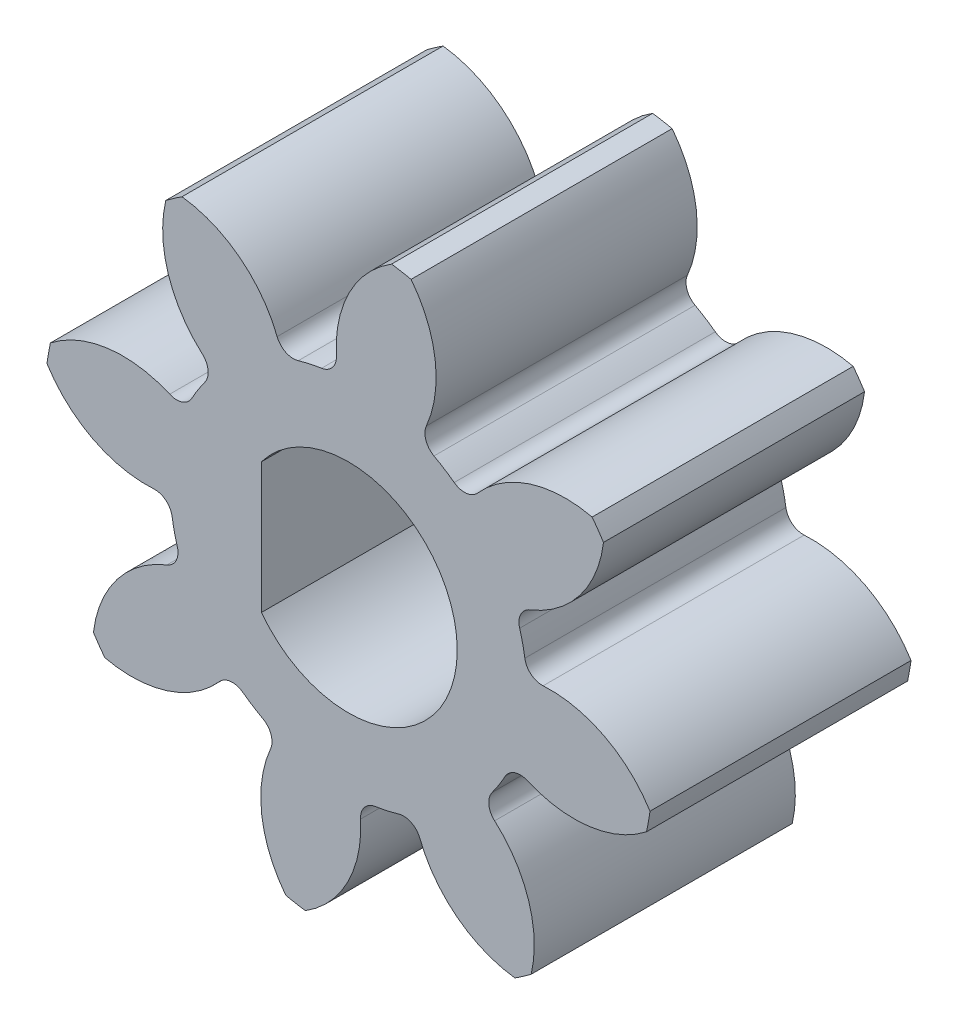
ISO-10303-21;
HEADER;
FILE_DESCRIPTION(('STEP AP214'),'2;1');
FILE_NAME('part.step','',(''),(''),'','','');
FILE_SCHEMA(('AUTOMOTIVE_DESIGN { 1 0 10303 214 1 1 1 1 }'));
ENDSEC;
DATA;
#1=APPLICATION_CONTEXT('core data for automotive mechanical design processes');
#2=APPLICATION_PROTOCOL_DEFINITION('international standard','automotive_design',2000,#1);
#3=PRODUCT_CONTEXT('',#1,'mechanical');
#4=PRODUCT('Part','Part','',(#3));
#5=PRODUCT_RELATED_PRODUCT_CATEGORY('part','',(#4));
#6=PRODUCT_DEFINITION_FORMATION('','',#4);
#7=PRODUCT_DEFINITION_CONTEXT('part definition',#1,'design');
#8=PRODUCT_DEFINITION('design','',#6,#7);
#9=PRODUCT_DEFINITION_SHAPE('','',#8);
#10=(LENGTH_UNIT() NAMED_UNIT(*) SI_UNIT(.MILLI.,.METRE.));
#11=(NAMED_UNIT(*) PLANE_ANGLE_UNIT() SI_UNIT($,.RADIAN.));
#12=(NAMED_UNIT(*) SI_UNIT($,.STERADIAN.) SOLID_ANGLE_UNIT());
#13=UNCERTAINTY_MEASURE_WITH_UNIT(LENGTH_MEASURE(1.E-05),#10,'distance_accuracy_value','');
#14=(GEOMETRIC_REPRESENTATION_CONTEXT(3) GLOBAL_UNCERTAINTY_ASSIGNED_CONTEXT((#13)) GLOBAL_UNIT_ASSIGNED_CONTEXT((#10,
#11,#12)) REPRESENTATION_CONTEXT('',''));
#15=CARTESIAN_POINT('',(0.,0.,0.));
#16=DIRECTION('',(0.,0.,1.));
#17=DIRECTION('',(1.,0.,0.));
#18=AXIS2_PLACEMENT_3D('',#15,#16,#17);
#19=CARTESIAN_POINT('',(0.,0.,-3.));
#20=DIRECTION('',(0.,0.,1.));
#21=DIRECTION('',(1.,0.,0.));
#22=AXIS2_PLACEMENT_3D('',#19,#20,#21);
#23=CYLINDRICAL_SURFACE('',#22,4.1);
#24=DIRECTION('',(0.,0.,1.));
#25=VECTOR('',#24,1.);
#26=CARTESIAN_POINT('',(-2.43019818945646,-3.30214123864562,-3.));
#27=LINE('',#26,#25);
#28=CARTESIAN_POINT('',(-2.43019818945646,-3.30214123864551,3.));
#29=VERTEX_POINT('',#28);
#30=CARTESIAN_POINT('',(-2.43019818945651,-3.30214123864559,-3.));
#31=VERTEX_POINT('',#30);
#32=EDGE_CURVE('E423',#29,#31,#27,.F.);
#33=ORIENTED_EDGE('',*,*,#32,.T.);
#34=CARTESIAN_POINT('',(0.,0.,-3.));
#35=DIRECTION('',(0.,0.,1.));
#36=DIRECTION('',(1.,0.,0.));
#37=AXIS2_PLACEMENT_3D('',#34,#35,#36);
#38=CIRCLE('',#37,4.1);
#39=CARTESIAN_POINT('',(-1.9657101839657,-3.59805273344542,-3.));
#40=VERTEX_POINT('',#39);
#41=EDGE_CURVE('E343',#31,#40,#38,.T.);
#42=ORIENTED_EDGE('',*,*,#41,.T.);
#43=DIRECTION('',(0.,0.,1.));
#44=VECTOR('',#43,1.);
#45=CARTESIAN_POINT('',(-1.96571018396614,-3.59805273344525,-3.));
#46=LINE('',#45,#44);
#47=CARTESIAN_POINT('',(-1.9657101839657,-3.59805273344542,3.));
#48=VERTEX_POINT('',#47);
#49=EDGE_CURVE('E345',#40,#48,#46,.T.);
#50=ORIENTED_EDGE('',*,*,#49,.T.);
#51=CARTESIAN_POINT('',(0.,0.,3.));
#52=DIRECTION('',(0.,0.,1.));
#53=DIRECTION('',(1.,0.,0.));
#54=AXIS2_PLACEMENT_3D('',#51,#52,#53);
#55=CIRCLE('',#54,4.1);
#56=EDGE_CURVE('E20',#48,#29,#55,.F.);
#57=ORIENTED_EDGE('',*,*,#56,.T.);
#58=EDGE_LOOP('',(#33,#42,#50,#57));
#59=FACE_BOUND('',#58,.T.);
#60=ADVANCED_FACE('F17',(#59),#23,.T.);
#61=CARTESIAN_POINT('',(0.,0.,-3.));
#62=DIRECTION('',(0.,0.,1.));
#63=DIRECTION('',(1.,0.,0.));
#64=AXIS2_PLACEMENT_3D('',#61,#62,#63);
#65=CYLINDRICAL_SURFACE('',#64,4.1);
#66=DIRECTION('',(0.,0.,1.));
#67=VECTOR('',#66,1.);
#68=CARTESIAN_POINT('',(0.61655684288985,-4.05337608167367,-3.));
#69=LINE('',#68,#67);
#70=CARTESIAN_POINT('',(0.616556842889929,-4.05337608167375,3.));
#71=VERTEX_POINT('',#70);
#72=CARTESIAN_POINT('',(0.616556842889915,-4.05337608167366,-3.));
#73=VERTEX_POINT('',#72);
#74=EDGE_CURVE('E418',#71,#73,#69,.F.);
#75=ORIENTED_EDGE('',*,*,#74,.T.);
#76=CARTESIAN_POINT('',(0.,0.,-3.));
#77=DIRECTION('',(0.,0.,1.));
#78=DIRECTION('',(1.,0.,0.));
#79=AXIS2_PLACEMENT_3D('',#76,#77,#78);
#80=CIRCLE('',#79,4.1);
#81=CARTESIAN_POINT('',(1.15424048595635,-3.93417448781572,-3.));
#82=VERTEX_POINT('',#81);
#83=EDGE_CURVE('E454',#73,#82,#80,.T.);
#84=ORIENTED_EDGE('',*,*,#83,.T.);
#85=DIRECTION('',(0.,0.,1.));
#86=VECTOR('',#85,1.);
#87=CARTESIAN_POINT('',(1.15424048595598,-3.93417448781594,-3.));
#88=LINE('',#87,#86);
#89=CARTESIAN_POINT('',(1.15424048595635,-3.93417448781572,3.));
#90=VERTEX_POINT('',#89);
#91=EDGE_CURVE('E412',#82,#90,#88,.T.);
#92=ORIENTED_EDGE('',*,*,#91,.T.);
#93=CARTESIAN_POINT('',(0.,0.,3.));
#94=DIRECTION('',(0.,0.,1.));
#95=DIRECTION('',(1.,0.,0.));
#96=AXIS2_PLACEMENT_3D('',#93,#94,#95);
#97=CIRCLE('',#96,4.1);
#98=EDGE_CURVE('E456',#90,#71,#97,.F.);
#99=ORIENTED_EDGE('',*,*,#98,.T.);
#100=EDGE_LOOP('',(#75,#84,#92,#99));
#101=FACE_BOUND('',#100,.T.);
#102=ADVANCED_FACE('F461',(#101),#65,.T.);
#103=CARTESIAN_POINT('',(0.,0.,-3.));
#104=DIRECTION('',(0.,0.,1.));
#105=DIRECTION('',(1.,0.,0.));
#106=AXIS2_PLACEMENT_3D('',#103,#104,#105);
#107=CYLINDRICAL_SURFACE('',#106,4.1);
#108=DIRECTION('',(0.,0.,1.));
#109=VECTOR('',#108,1.);
#110=CARTESIAN_POINT('',(3.30214123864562,-2.43019818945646,-3.));
#111=LINE('',#110,#109);
#112=CARTESIAN_POINT('',(3.30214123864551,-2.43019818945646,3.));
#113=VERTEX_POINT('',#112);
#114=CARTESIAN_POINT('',(3.30214123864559,-2.43019818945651,-3.));
#115=VERTEX_POINT('',#114);
#116=EDGE_CURVE('E409',#113,#115,#111,.F.);
#117=ORIENTED_EDGE('',*,*,#116,.T.);
#118=CARTESIAN_POINT('',(0.,0.,-3.));
#119=DIRECTION('',(0.,0.,1.));
#120=DIRECTION('',(1.,0.,0.));
#121=AXIS2_PLACEMENT_3D('',#118,#119,#120);
#122=CIRCLE('',#121,4.1);
#123=CARTESIAN_POINT('',(3.59805273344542,-1.9657101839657,-3.));
#124=VERTEX_POINT('',#123);
#125=EDGE_CURVE('E450',#115,#124,#122,.T.);
#126=ORIENTED_EDGE('',*,*,#125,.T.);
#127=DIRECTION('',(0.,0.,1.));
#128=VECTOR('',#127,1.);
#129=CARTESIAN_POINT('',(3.59805273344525,-1.96571018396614,-3.));
#130=LINE('',#129,#128);
#131=CARTESIAN_POINT('',(3.59805273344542,-1.9657101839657,3.));
#132=VERTEX_POINT('',#131);
#133=EDGE_CURVE('E403',#124,#132,#130,.T.);
#134=ORIENTED_EDGE('',*,*,#133,.T.);
#135=CARTESIAN_POINT('',(0.,0.,3.));
#136=DIRECTION('',(0.,0.,1.));
#137=DIRECTION('',(1.,0.,0.));
#138=AXIS2_PLACEMENT_3D('',#135,#136,#137);
#139=CIRCLE('',#138,4.1);
#140=EDGE_CURVE('E452',#132,#113,#139,.F.);
#141=ORIENTED_EDGE('',*,*,#140,.T.);
#142=EDGE_LOOP('',(#117,#126,#134,#141));
#143=FACE_BOUND('',#142,.T.);
#144=ADVANCED_FACE('F946',(#143),#107,.T.);
#145=CARTESIAN_POINT('',(0.,0.,-3.));
#146=DIRECTION('',(0.,0.,1.));
#147=DIRECTION('',(1.,0.,0.));
#148=AXIS2_PLACEMENT_3D('',#145,#146,#147);
#149=CYLINDRICAL_SURFACE('',#148,4.1);
#150=DIRECTION('',(0.,0.,1.));
#151=VECTOR('',#150,1.);
#152=CARTESIAN_POINT('',(4.05337608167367,0.61655684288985,-3.));
#153=LINE('',#152,#151);
#154=CARTESIAN_POINT('',(4.05337608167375,0.616556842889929,3.));
#155=VERTEX_POINT('',#154);
#156=CARTESIAN_POINT('',(4.05337608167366,0.616556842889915,-3.));
#157=VERTEX_POINT('',#156);
#158=EDGE_CURVE('E400',#155,#157,#153,.F.);
#159=ORIENTED_EDGE('',*,*,#158,.T.);
#160=CARTESIAN_POINT('',(0.,0.,-3.));
#161=DIRECTION('',(0.,0.,1.));
#162=DIRECTION('',(1.,0.,0.));
#163=AXIS2_PLACEMENT_3D('',#160,#161,#162);
#164=CIRCLE('',#163,4.1);
#165=CARTESIAN_POINT('',(3.93417448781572,1.15424048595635,-3.));
#166=VERTEX_POINT('',#165);
#167=EDGE_CURVE('E446',#157,#166,#164,.T.);
#168=ORIENTED_EDGE('',*,*,#167,.T.);
#169=DIRECTION('',(0.,0.,1.));
#170=VECTOR('',#169,1.);
#171=CARTESIAN_POINT('',(3.93417448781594,1.15424048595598,-3.));
#172=LINE('',#171,#170);
#173=CARTESIAN_POINT('',(3.93417448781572,1.15424048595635,3.));
#174=VERTEX_POINT('',#173);
#175=EDGE_CURVE('E394',#166,#174,#172,.T.);
#176=ORIENTED_EDGE('',*,*,#175,.T.);
#177=CARTESIAN_POINT('',(0.,0.,3.));
#178=DIRECTION('',(0.,0.,1.));
#179=DIRECTION('',(1.,0.,0.));
#180=AXIS2_PLACEMENT_3D('',#177,#178,#179);
#181=CIRCLE('',#180,4.1);
#182=EDGE_CURVE('E448',#174,#155,#181,.F.);
#183=ORIENTED_EDGE('',*,*,#182,.T.);
#184=EDGE_LOOP('',(#159,#168,#176,#183));
#185=FACE_BOUND('',#184,.T.);
#186=ADVANCED_FACE('F924',(#185),#149,.T.);
#187=CARTESIAN_POINT('',(0.,0.,-3.));
#188=DIRECTION('',(0.,0.,1.));
#189=DIRECTION('',(1.,0.,0.));
#190=AXIS2_PLACEMENT_3D('',#187,#188,#189);
#191=CYLINDRICAL_SURFACE('',#190,4.1);
#192=DIRECTION('',(0.,0.,1.));
#193=VECTOR('',#192,1.);
#194=CARTESIAN_POINT('',(2.43019818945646,3.30214123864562,-3.));
#195=LINE('',#194,#193);
#196=CARTESIAN_POINT('',(2.43019818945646,3.30214123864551,3.));
#197=VERTEX_POINT('',#196);
#198=CARTESIAN_POINT('',(2.43019818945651,3.30214123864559,-3.));
#199=VERTEX_POINT('',#198);
#200=EDGE_CURVE('E391',#197,#199,#195,.F.);
#201=ORIENTED_EDGE('',*,*,#200,.T.);
#202=CARTESIAN_POINT('',(0.,0.,-3.));
#203=DIRECTION('',(0.,0.,1.));
#204=DIRECTION('',(1.,0.,0.));
#205=AXIS2_PLACEMENT_3D('',#202,#203,#204);
#206=CIRCLE('',#205,4.1);
#207=CARTESIAN_POINT('',(1.9657101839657,3.59805273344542,-3.));
#208=VERTEX_POINT('',#207);
#209=EDGE_CURVE('E442',#199,#208,#206,.T.);
#210=ORIENTED_EDGE('',*,*,#209,.T.);
#211=DIRECTION('',(0.,0.,1.));
#212=VECTOR('',#211,1.);
#213=CARTESIAN_POINT('',(1.96571018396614,3.59805273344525,-3.));
#214=LINE('',#213,#212);
#215=CARTESIAN_POINT('',(1.9657101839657,3.59805273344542,3.));
#216=VERTEX_POINT('',#215);
#217=EDGE_CURVE('E385',#208,#216,#214,.T.);
#218=ORIENTED_EDGE('',*,*,#217,.T.);
#219=CARTESIAN_POINT('',(0.,0.,3.));
#220=DIRECTION('',(0.,0.,1.));
#221=DIRECTION('',(1.,0.,0.));
#222=AXIS2_PLACEMENT_3D('',#219,#220,#221);
#223=CIRCLE('',#222,4.1);
#224=EDGE_CURVE('E444',#216,#197,#223,.F.);
#225=ORIENTED_EDGE('',*,*,#224,.T.);
#226=EDGE_LOOP('',(#201,#210,#218,#225));
#227=FACE_BOUND('',#226,.T.);
#228=ADVANCED_FACE('F902',(#227),#191,.T.);
#229=CARTESIAN_POINT('',(0.,0.,-3.));
#230=DIRECTION('',(0.,0.,1.));
#231=DIRECTION('',(1.,0.,0.));
#232=AXIS2_PLACEMENT_3D('',#229,#230,#231);
#233=CYLINDRICAL_SURFACE('',#232,4.1);
#234=DIRECTION('',(0.,0.,1.));
#235=VECTOR('',#234,1.);
#236=CARTESIAN_POINT('',(-0.61655684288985,4.05337608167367,-3.));
#237=LINE('',#236,#235);
#238=CARTESIAN_POINT('',(-0.616556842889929,4.05337608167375,3.));
#239=VERTEX_POINT('',#238);
#240=CARTESIAN_POINT('',(-0.616556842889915,4.05337608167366,-3.));
#241=VERTEX_POINT('',#240);
#242=EDGE_CURVE('E382',#239,#241,#237,.F.);
#243=ORIENTED_EDGE('',*,*,#242,.T.);
#244=CARTESIAN_POINT('',(0.,0.,-3.));
#245=DIRECTION('',(0.,0.,1.));
#246=DIRECTION('',(1.,0.,0.));
#247=AXIS2_PLACEMENT_3D('',#244,#245,#246);
#248=CIRCLE('',#247,4.1);
#249=CARTESIAN_POINT('',(-1.15424048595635,3.93417448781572,-3.));
#250=VERTEX_POINT('',#249);
#251=EDGE_CURVE('E438',#241,#250,#248,.T.);
#252=ORIENTED_EDGE('',*,*,#251,.T.);
#253=DIRECTION('',(0.,0.,1.));
#254=VECTOR('',#253,1.);
#255=CARTESIAN_POINT('',(-1.15424048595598,3.93417448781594,-3.));
#256=LINE('',#255,#254);
#257=CARTESIAN_POINT('',(-1.15424048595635,3.93417448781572,3.));
#258=VERTEX_POINT('',#257);
#259=EDGE_CURVE('E376',#250,#258,#256,.T.);
#260=ORIENTED_EDGE('',*,*,#259,.T.);
#261=CARTESIAN_POINT('',(0.,0.,3.));
#262=DIRECTION('',(0.,0.,1.));
#263=DIRECTION('',(1.,0.,0.));
#264=AXIS2_PLACEMENT_3D('',#261,#262,#263);
#265=CIRCLE('',#264,4.1);
#266=EDGE_CURVE('E440',#258,#239,#265,.F.);
#267=ORIENTED_EDGE('',*,*,#266,.T.);
#268=EDGE_LOOP('',(#243,#252,#260,#267));
#269=FACE_BOUND('',#268,.T.);
#270=ADVANCED_FACE('F880',(#269),#233,.T.);
#271=CARTESIAN_POINT('',(0.,0.,-3.));
#272=DIRECTION('',(0.,0.,1.));
#273=DIRECTION('',(1.,0.,0.));
#274=AXIS2_PLACEMENT_3D('',#271,#272,#273);
#275=CYLINDRICAL_SURFACE('',#274,4.1);
#276=DIRECTION('',(0.,0.,1.));
#277=VECTOR('',#276,1.);
#278=CARTESIAN_POINT('',(-3.30214123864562,2.43019818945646,-3.));
#279=LINE('',#278,#277);
#280=CARTESIAN_POINT('',(-3.30214123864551,2.43019818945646,3.));
#281=VERTEX_POINT('',#280);
#282=CARTESIAN_POINT('',(-3.30214123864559,2.43019818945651,-3.));
#283=VERTEX_POINT('',#282);
#284=EDGE_CURVE('E373',#281,#283,#279,.F.);
#285=ORIENTED_EDGE('',*,*,#284,.T.);
#286=CARTESIAN_POINT('',(0.,0.,-3.));
#287=DIRECTION('',(0.,0.,1.));
#288=DIRECTION('',(1.,0.,0.));
#289=AXIS2_PLACEMENT_3D('',#286,#287,#288);
#290=CIRCLE('',#289,4.1);
#291=CARTESIAN_POINT('',(-3.59805273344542,1.9657101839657,-3.));
#292=VERTEX_POINT('',#291);
#293=EDGE_CURVE('E434',#283,#292,#290,.T.);
#294=ORIENTED_EDGE('',*,*,#293,.T.);
#295=DIRECTION('',(0.,0.,1.));
#296=VECTOR('',#295,1.);
#297=CARTESIAN_POINT('',(-3.59805273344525,1.96571018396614,-3.));
#298=LINE('',#297,#296);
#299=CARTESIAN_POINT('',(-3.59805273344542,1.9657101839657,3.));
#300=VERTEX_POINT('',#299);
#301=EDGE_CURVE('E367',#292,#300,#298,.T.);
#302=ORIENTED_EDGE('',*,*,#301,.T.);
#303=CARTESIAN_POINT('',(0.,0.,3.));
#304=DIRECTION('',(0.,0.,1.));
#305=DIRECTION('',(1.,0.,0.));
#306=AXIS2_PLACEMENT_3D('',#303,#304,#305);
#307=CIRCLE('',#306,4.1);
#308=EDGE_CURVE('E436',#300,#281,#307,.F.);
#309=ORIENTED_EDGE('',*,*,#308,.T.);
#310=EDGE_LOOP('',(#285,#294,#302,#309));
#311=FACE_BOUND('',#310,.T.);
#312=ADVANCED_FACE('F858',(#311),#275,.T.);
#313=CARTESIAN_POINT('',(0.,0.,-3.));
#314=DIRECTION('',(0.,0.,1.));
#315=DIRECTION('',(1.,0.,0.));
#316=AXIS2_PLACEMENT_3D('',#313,#314,#315);
#317=CYLINDRICAL_SURFACE('',#316,4.1);
#318=DIRECTION('',(0.,0.,1.));
#319=VECTOR('',#318,1.);
#320=CARTESIAN_POINT('',(-3.93417448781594,-1.15424048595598,-3.));
#321=LINE('',#320,#319);
#322=CARTESIAN_POINT('',(-3.93417448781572,-1.15424048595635,-3.));
#323=VERTEX_POINT('',#322);
#324=CARTESIAN_POINT('',(-3.93417448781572,-1.15424048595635,3.));
#325=VERTEX_POINT('',#324);
#326=EDGE_CURVE('E426',#323,#325,#321,.T.);
#327=ORIENTED_EDGE('',*,*,#326,.T.);
#328=CARTESIAN_POINT('',(0.,0.,3.));
#329=DIRECTION('',(0.,0.,1.));
#330=DIRECTION('',(1.,0.,0.));
#331=AXIS2_PLACEMENT_3D('',#328,#329,#330);
#332=CIRCLE('',#331,4.1);
#333=CARTESIAN_POINT('',(-4.05337608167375,-0.616556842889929,3.));
#334=VERTEX_POINT('',#333);
#335=EDGE_CURVE('E430',#325,#334,#332,.F.);
#336=ORIENTED_EDGE('',*,*,#335,.T.);
#337=DIRECTION('',(0.,0.,1.));
#338=VECTOR('',#337,1.);
#339=CARTESIAN_POINT('',(-4.05337608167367,-0.61655684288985,-3.));
#340=LINE('',#339,#338);
#341=CARTESIAN_POINT('',(-4.05337608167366,-0.616556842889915,-3.));
#342=VERTEX_POINT('',#341);
#343=EDGE_CURVE('E361',#334,#342,#340,.F.);
#344=ORIENTED_EDGE('',*,*,#343,.T.);
#345=CARTESIAN_POINT('',(0.,0.,-3.));
#346=DIRECTION('',(0.,0.,1.));
#347=DIRECTION('',(1.,0.,0.));
#348=AXIS2_PLACEMENT_3D('',#345,#346,#347);
#349=CIRCLE('',#348,4.1);
#350=EDGE_CURVE('E432',#342,#323,#349,.T.);
#351=ORIENTED_EDGE('',*,*,#350,.T.);
#352=EDGE_LOOP('',(#327,#336,#344,#351));
#353=FACE_BOUND('',#352,.T.);
#354=ADVANCED_FACE('F840',(#353),#317,.T.);
#355=CARTESIAN_POINT('',(-4.317996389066,-1.266849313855,-3.));
#356=DIRECTION('',(0.,0.,1.));
#357=DIRECTION('',(1.,0.,0.));
#358=AXIS2_PLACEMENT_3D('',#355,#356,#357);
#359=CYLINDRICAL_SURFACE('',#358,0.4);
#360=CARTESIAN_POINT('',(-4.317996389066,-1.266849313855,3.));
#361=DIRECTION('',(0.,0.,1.));
#362=DIRECTION('',(1.,0.,0.));
#363=AXIS2_PLACEMENT_3D('',#360,#361,#362);
#364=CIRCLE('',#363,0.4);
#365=CARTESIAN_POINT('',(-4.17135281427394,-1.63899936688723,3.));
#366=VERTEX_POINT('',#365);
#367=EDGE_CURVE('E517',#325,#366,#364,.F.);
#368=ORIENTED_EDGE('',*,*,#367,.F.);
#369=ORIENTED_EDGE('',*,*,#326,.F.);
#370=CARTESIAN_POINT('',(-4.317996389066,-1.266849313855,-3.));
#371=DIRECTION('',(0.,0.,1.));
#372=DIRECTION('',(1.,0.,0.));
#373=AXIS2_PLACEMENT_3D('',#370,#371,#372);
#374=CIRCLE('',#373,0.4);
#375=CARTESIAN_POINT('',(-4.17135281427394,-1.63899936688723,-3.));
#376=VERTEX_POINT('',#375);
#377=EDGE_CURVE('E427',#376,#323,#374,.T.);
#378=ORIENTED_EDGE('',*,*,#377,.F.);
#379=DIRECTION('',(0.,0.,1.));
#380=VECTOR('',#379,1.);
#381=CARTESIAN_POINT('',(-4.17135281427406,-1.63899936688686,-3.));
#382=LINE('',#381,#380);
#383=EDGE_CURVE('E526',#366,#376,#382,.F.);
#384=ORIENTED_EDGE('',*,*,#383,.F.);
#385=EDGE_LOOP('',(#368,#369,#378,#384));
#386=FACE_BOUND('',#385,.T.);
#387=ADVANCED_FACE('F838',(#386),#359,.F.);
#388=CARTESIAN_POINT('',(-2.667290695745,-3.624301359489,-3.));
#389=DIRECTION('',(0.,0.,1.));
#390=DIRECTION('',(1.,0.,0.));
#391=AXIS2_PLACEMENT_3D('',#388,#389,#390);
#392=CYLINDRICAL_SURFACE('',#391,0.4);
#393=CARTESIAN_POINT('',(-2.667290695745,-3.624301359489,3.));
#394=DIRECTION('',(0.,0.,1.));
#395=DIRECTION('',(1.,0.,0.));
#396=AXIS2_PLACEMENT_3D('',#393,#394,#395);
#397=CIRCLE('',#396,0.4);
#398=CARTESIAN_POINT('',(-2.96684229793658,-3.35921865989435,3.));
#399=VERTEX_POINT('',#398);
#400=EDGE_CURVE('E339',#399,#29,#397,.F.);
#401=ORIENTED_EDGE('',*,*,#400,.F.);
#402=DIRECTION('',(0.,0.,1.));
#403=VECTOR('',#402,1.);
#404=CARTESIAN_POINT('',(-2.96684229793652,-3.35921865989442,-3.));
#405=LINE('',#404,#403);
#406=CARTESIAN_POINT('',(-2.96684229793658,-3.35921865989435,-3.));
#407=VERTEX_POINT('',#406);
#408=EDGE_CURVE('E531',#407,#399,#405,.T.);
#409=ORIENTED_EDGE('',*,*,#408,.F.);
#410=CARTESIAN_POINT('',(-2.667290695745,-3.624301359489,-3.));
#411=DIRECTION('',(0.,0.,1.));
#412=DIRECTION('',(1.,0.,0.));
#413=AXIS2_PLACEMENT_3D('',#410,#411,#412);
#414=CIRCLE('',#413,0.4);
#415=EDGE_CURVE('E424',#31,#407,#414,.T.);
#416=ORIENTED_EDGE('',*,*,#415,.F.);
#417=ORIENTED_EDGE('',*,*,#32,.F.);
#418=EDGE_LOOP('',(#401,#409,#416,#417));
#419=FACE_BOUND('',#418,.T.);
#420=ADVANCED_FACE('F830',(#419),#392,.F.);
#421=CARTESIAN_POINT('',(0.,0.,-3.));
#422=DIRECTION('',(0.,0.,1.));
#423=DIRECTION('',(1.,0.,0.));
#424=AXIS2_PLACEMENT_3D('',#421,#422,#423);
#425=CYLINDRICAL_SURFACE('',#424,7.);
#426=DIRECTION('',(0.,0.,1.));
#427=VECTOR('',#426,1.);
#428=CARTESIAN_POINT('',(-5.86187748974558,-3.82601519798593,-3.));
#429=LINE('',#428,#427);
#430=CARTESIAN_POINT('',(-5.86187748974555,-3.82601519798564,-3.));
#431=VERTEX_POINT('',#430);
#432=CARTESIAN_POINT('',(-5.86187748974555,-3.82601519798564,3.));
#433=VERTEX_POINT('',#432);
#434=EDGE_CURVE('E522',#431,#433,#429,.T.);
#435=ORIENTED_EDGE('',*,*,#434,.F.);
#436=CARTESIAN_POINT('',(0.,0.,-3.));
#437=DIRECTION('',(0.,0.,1.));
#438=DIRECTION('',(1.,0.,0.));
#439=AXIS2_PLACEMENT_3D('',#436,#437,#438);
#440=CIRCLE('',#439,7.);
#441=CARTESIAN_POINT('',(-5.60015842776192,-4.19978875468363,-3.));
#442=VERTEX_POINT('',#441);
#443=EDGE_CURVE('E421',#431,#442,#440,.T.);
#444=ORIENTED_EDGE('',*,*,#443,.T.);
#445=DIRECTION('',(0.,0.,1.));
#446=VECTOR('',#445,1.);
#447=CARTESIAN_POINT('',(-5.60015842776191,-4.19978875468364,-3.));
#448=LINE('',#447,#446);
#449=CARTESIAN_POINT('',(-5.60015842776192,-4.19978875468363,3.));
#450=VERTEX_POINT('',#449);
#451=EDGE_CURVE('E530',#450,#442,#448,.F.);
#452=ORIENTED_EDGE('',*,*,#451,.F.);
#453=CARTESIAN_POINT('',(0.,0.,3.));
#454=DIRECTION('',(0.,0.,1.));
#455=DIRECTION('',(1.,0.,0.));
#456=AXIS2_PLACEMENT_3D('',#453,#454,#455);
#457=CIRCLE('',#456,7.);
#458=EDGE_CURVE('E519',#433,#450,#457,.T.);
#459=ORIENTED_EDGE('',*,*,#458,.F.);
#460=EDGE_LOOP('',(#435,#444,#452,#459));
#461=FACE_BOUND('',#460,.T.);
#462=ADVANCED_FACE('F832',(#461),#425,.T.);
#463=CARTESIAN_POINT('',(-2.157486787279,-3.949082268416,-3.));
#464=DIRECTION('',(0.,0.,1.));
#465=DIRECTION('',(1.,0.,0.));
#466=AXIS2_PLACEMENT_3D('',#463,#464,#465);
#467=CYLINDRICAL_SURFACE('',#466,0.4);
#468=CARTESIAN_POINT('',(-2.157486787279,-3.949082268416,3.));
#469=DIRECTION('',(0.,0.,1.));
#470=DIRECTION('',(1.,0.,0.));
#471=AXIS2_PLACEMENT_3D('',#468,#469,#470);
#472=CIRCLE('',#471,0.4);
#473=CARTESIAN_POINT('',(-1.79064429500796,-4.10853942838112,3.));
#474=VERTEX_POINT('',#473);
#475=EDGE_CURVE('E335',#48,#474,#472,.F.);
#476=ORIENTED_EDGE('',*,*,#475,.F.);
#477=ORIENTED_EDGE('',*,*,#49,.F.);
#478=CARTESIAN_POINT('',(-2.157486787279,-3.949082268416,-3.));
#479=DIRECTION('',(0.,0.,1.));
#480=DIRECTION('',(1.,0.,0.));
#481=AXIS2_PLACEMENT_3D('',#478,#479,#480);
#482=CIRCLE('',#481,0.4);
#483=CARTESIAN_POINT('',(-1.79064429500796,-4.10853942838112,-3.));
#484=VERTEX_POINT('',#483);
#485=EDGE_CURVE('E350',#484,#40,#482,.T.);
#486=ORIENTED_EDGE('',*,*,#485,.F.);
#487=DIRECTION('',(0.,0.,1.));
#488=VECTOR('',#487,1.);
#489=CARTESIAN_POINT('',(-1.79064429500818,-4.10853942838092,-3.));
#490=LINE('',#489,#488);
#491=EDGE_CURVE('E355',#474,#484,#490,.F.);
#492=ORIENTED_EDGE('',*,*,#491,.F.);
#493=EDGE_LOOP('',(#476,#477,#486,#492));
#494=FACE_BOUND('',#493,.T.);
#495=ADVANCED_FACE('F353',(#494),#467,.F.);
#496=CARTESIAN_POINT('',(0.6767087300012,-4.448827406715,-3.));
#497=DIRECTION('',(0.,0.,1.));
#498=DIRECTION('',(1.,0.,0.));
#499=AXIS2_PLACEMENT_3D('',#496,#497,#498);
#500=CYLINDRICAL_SURFACE('',#499,0.4);
#501=CARTESIAN_POINT('',(0.6767087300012,-4.448827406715,3.));
#502=DIRECTION('',(0.,0.,1.));
#503=DIRECTION('',(1.,0.,0.));
#504=AXIS2_PLACEMENT_3D('',#501,#502,#503);
#505=CIRCLE('',#504,0.4);
#506=CARTESIAN_POINT('',(0.277451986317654,-4.47320060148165,3.));
#507=VERTEX_POINT('',#506);
#508=EDGE_CURVE('E359',#507,#71,#505,.F.);
#509=ORIENTED_EDGE('',*,*,#508,.F.);
#510=DIRECTION('',(0.,0.,1.));
#511=VECTOR('',#510,1.);
#512=CARTESIAN_POINT('',(0.277451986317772,-4.47320060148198,-3.));
#513=LINE('',#512,#511);
#514=CARTESIAN_POINT('',(0.277451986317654,-4.47320060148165,-3.));
#515=VERTEX_POINT('',#514);
#516=EDGE_CURVE('E537',#515,#507,#513,.T.);
#517=ORIENTED_EDGE('',*,*,#516,.F.);
#518=CARTESIAN_POINT('',(0.6767087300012,-4.448827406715,-3.));
#519=DIRECTION('',(0.,0.,1.));
#520=DIRECTION('',(1.,0.,0.));
#521=AXIS2_PLACEMENT_3D('',#518,#519,#520);
#522=CIRCLE('',#521,0.4);
#523=EDGE_CURVE('E349',#73,#515,#522,.T.);
#524=ORIENTED_EDGE('',*,*,#523,.F.);
#525=ORIENTED_EDGE('',*,*,#74,.F.);
#526=EDGE_LOOP('',(#509,#517,#524,#525));
#527=FACE_BOUND('',#526,.T.);
#528=ADVANCED_FACE('F467',(#527),#500,.F.);
#529=CARTESIAN_POINT('',(0.,0.,-3.));
#530=DIRECTION('',(0.,0.,1.));
#531=DIRECTION('',(1.,0.,0.));
#532=AXIS2_PLACEMENT_3D('',#529,#530,#531);
#533=CYLINDRICAL_SURFACE('',#532,7.);
#534=DIRECTION('',(0.,0.,1.));
#535=VECTOR('',#534,1.);
#536=CARTESIAN_POINT('',(-1.43957203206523,-6.85037461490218,-3.));
#537=LINE('',#536,#535);
#538=CARTESIAN_POINT('',(-1.43957203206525,-6.85037461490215,-3.));
#539=VERTEX_POINT('',#538);
#540=CARTESIAN_POINT('',(-1.43957203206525,-6.85037461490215,3.));
#541=VERTEX_POINT('',#540);
#542=EDGE_CURVE('E534',#539,#541,#537,.T.);
#543=ORIENTED_EDGE('',*,*,#542,.F.);
#544=CARTESIAN_POINT('',(0.,0.,-3.));
#545=DIRECTION('',(0.,0.,1.));
#546=DIRECTION('',(1.,0.,0.));
#547=AXIS2_PLACEMENT_3D('',#544,#545,#546);
#548=CIRCLE('',#547,7.);
#549=CARTESIAN_POINT('',(-0.990210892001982,-6.92960910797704,-3.));
#550=VERTEX_POINT('',#549);
#551=EDGE_CURVE('E416',#539,#550,#548,.T.);
#552=ORIENTED_EDGE('',*,*,#551,.T.);
#553=DIRECTION('',(0.,0.,1.));
#554=VECTOR('',#553,1.);
#555=CARTESIAN_POINT('',(-0.990210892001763,-6.9296091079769,-3.));
#556=LINE('',#555,#554);
#557=CARTESIAN_POINT('',(-0.990210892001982,-6.92960910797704,3.));
#558=VERTEX_POINT('',#557);
#559=EDGE_CURVE('E536',#558,#550,#556,.F.);
#560=ORIENTED_EDGE('',*,*,#559,.F.);
#561=CARTESIAN_POINT('',(0.,0.,3.));
#562=DIRECTION('',(0.,0.,1.));
#563=DIRECTION('',(1.,0.,0.));
#564=AXIS2_PLACEMENT_3D('',#561,#562,#563);
#565=CIRCLE('',#564,7.);
#566=EDGE_CURVE('E356',#541,#558,#565,.T.);
#567=ORIENTED_EDGE('',*,*,#566,.F.);
#568=EDGE_LOOP('',(#543,#552,#560,#567));
#569=FACE_BOUND('',#568,.T.);
#570=ADVANCED_FACE('F965',(#569),#533,.T.);
#571=CARTESIAN_POINT('',(1.266849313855,-4.317996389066,-3.));
#572=DIRECTION('',(0.,0.,1.));
#573=DIRECTION('',(1.,0.,0.));
#574=AXIS2_PLACEMENT_3D('',#571,#572,#573);
#575=CYLINDRICAL_SURFACE('',#574,0.4);
#576=CARTESIAN_POINT('',(1.266849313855,-4.317996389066,3.));
#577=DIRECTION('',(0.,0.,1.));
#578=DIRECTION('',(1.,0.,0.));
#579=AXIS2_PLACEMENT_3D('',#576,#577,#578);
#580=CIRCLE('',#579,0.4);
#581=CARTESIAN_POINT('',(1.63899936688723,-4.17135281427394,3.));
#582=VERTEX_POINT('',#581);
#583=EDGE_CURVE('E474',#90,#582,#580,.F.);
#584=ORIENTED_EDGE('',*,*,#583,.F.);
#585=ORIENTED_EDGE('',*,*,#91,.F.);
#586=CARTESIAN_POINT('',(1.266849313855,-4.317996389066,-3.));
#587=DIRECTION('',(0.,0.,1.));
#588=DIRECTION('',(1.,0.,0.));
#589=AXIS2_PLACEMENT_3D('',#586,#587,#588);
#590=CIRCLE('',#589,0.4);
#591=CARTESIAN_POINT('',(1.63899936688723,-4.17135281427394,-3.));
#592=VERTEX_POINT('',#591);
#593=EDGE_CURVE('E413',#592,#82,#590,.T.);
#594=ORIENTED_EDGE('',*,*,#593,.F.);
#595=DIRECTION('',(0.,0.,1.));
#596=VECTOR('',#595,1.);
#597=CARTESIAN_POINT('',(1.63899936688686,-4.17135281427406,-3.));
#598=LINE('',#597,#596);
#599=EDGE_CURVE('E541',#582,#592,#598,.F.);
#600=ORIENTED_EDGE('',*,*,#599,.F.);
#601=EDGE_LOOP('',(#584,#585,#594,#600));
#602=FACE_BOUND('',#601,.T.);
#603=ADVANCED_FACE('F963',(#602),#575,.F.);
#604=CARTESIAN_POINT('',(3.624301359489,-2.667290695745,-3.));
#605=DIRECTION('',(0.,0.,1.));
#606=DIRECTION('',(1.,0.,0.));
#607=AXIS2_PLACEMENT_3D('',#604,#605,#606);
#608=CYLINDRICAL_SURFACE('',#607,0.4);
#609=CARTESIAN_POINT('',(3.624301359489,-2.667290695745,3.));
#610=DIRECTION('',(0.,0.,1.));
#611=DIRECTION('',(1.,0.,0.));
#612=AXIS2_PLACEMENT_3D('',#609,#610,#611);
#613=CIRCLE('',#612,0.4);
#614=CARTESIAN_POINT('',(3.35921865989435,-2.96684229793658,3.));
#615=VERTEX_POINT('',#614);
#616=EDGE_CURVE('E479',#615,#113,#613,.F.);
#617=ORIENTED_EDGE('',*,*,#616,.F.);
#618=DIRECTION('',(0.,0.,1.));
#619=VECTOR('',#618,1.);
#620=CARTESIAN_POINT('',(3.35921865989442,-2.96684229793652,-3.));
#621=LINE('',#620,#619);
#622=CARTESIAN_POINT('',(3.35921865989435,-2.96684229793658,-3.));
#623=VERTEX_POINT('',#622);
#624=EDGE_CURVE('E547',#623,#615,#621,.T.);
#625=ORIENTED_EDGE('',*,*,#624,.F.);
#626=CARTESIAN_POINT('',(3.624301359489,-2.667290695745,-3.));
#627=DIRECTION('',(0.,0.,1.));
#628=DIRECTION('',(1.,0.,0.));
#629=AXIS2_PLACEMENT_3D('',#626,#627,#628);
#630=CIRCLE('',#629,0.4);
#631=EDGE_CURVE('E410',#115,#623,#630,.T.);
#632=ORIENTED_EDGE('',*,*,#631,.F.);
#633=ORIENTED_EDGE('',*,*,#116,.F.);
#634=EDGE_LOOP('',(#617,#625,#632,#633));
#635=FACE_BOUND('',#634,.T.);
#636=ADVANCED_FACE('F952',(#635),#608,.F.);
#637=CARTESIAN_POINT('',(0.,0.,-3.));
#638=DIRECTION('',(0.,0.,1.));
#639=DIRECTION('',(1.,0.,0.));
#640=AXIS2_PLACEMENT_3D('',#637,#638,#639);
#641=CYLINDRICAL_SURFACE('',#640,7.);
#642=DIRECTION('',(0.,0.,1.));
#643=VECTOR('',#642,1.);
#644=CARTESIAN_POINT('',(3.82601519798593,-5.86187748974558,-3.));
#645=LINE('',#644,#643);
#646=CARTESIAN_POINT('',(3.82601519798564,-5.86187748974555,-3.));
#647=VERTEX_POINT('',#646);
#648=CARTESIAN_POINT('',(3.82601519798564,-5.86187748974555,3.));
#649=VERTEX_POINT('',#648);
#650=EDGE_CURVE('E542',#647,#649,#645,.T.);
#651=ORIENTED_EDGE('',*,*,#650,.F.);
#652=CARTESIAN_POINT('',(0.,0.,-3.));
#653=DIRECTION('',(0.,0.,1.));
#654=DIRECTION('',(1.,0.,0.));
#655=AXIS2_PLACEMENT_3D('',#652,#653,#654);
#656=CIRCLE('',#655,7.);
#657=CARTESIAN_POINT('',(4.19978875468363,-5.60015842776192,-3.));
#658=VERTEX_POINT('',#657);
#659=EDGE_CURVE('E407',#647,#658,#656,.T.);
#660=ORIENTED_EDGE('',*,*,#659,.T.);
#661=DIRECTION('',(0.,0.,1.));
#662=VECTOR('',#661,1.);
#663=CARTESIAN_POINT('',(4.19978875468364,-5.60015842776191,-3.));
#664=LINE('',#663,#662);
#665=CARTESIAN_POINT('',(4.19978875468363,-5.60015842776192,3.));
#666=VERTEX_POINT('',#665);
#667=EDGE_CURVE('E546',#666,#658,#664,.F.);
#668=ORIENTED_EDGE('',*,*,#667,.F.);
#669=CARTESIAN_POINT('',(0.,0.,3.));
#670=DIRECTION('',(0.,0.,1.));
#671=DIRECTION('',(1.,0.,0.));
#672=AXIS2_PLACEMENT_3D('',#669,#670,#671);
#673=CIRCLE('',#672,7.);
#674=EDGE_CURVE('E475',#649,#666,#673,.T.);
#675=ORIENTED_EDGE('',*,*,#674,.F.);
#676=EDGE_LOOP('',(#651,#660,#668,#675));
#677=FACE_BOUND('',#676,.T.);
#678=ADVANCED_FACE('F958',(#677),#641,.T.);
#679=CARTESIAN_POINT('',(3.949082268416,-2.157486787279,-3.));
#680=DIRECTION('',(0.,0.,1.));
#681=DIRECTION('',(1.,0.,0.));
#682=AXIS2_PLACEMENT_3D('',#679,#680,#681);
#683=CYLINDRICAL_SURFACE('',#682,0.4);
#684=CARTESIAN_POINT('',(3.949082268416,-2.157486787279,3.));
#685=DIRECTION('',(0.,0.,1.));
#686=DIRECTION('',(1.,0.,0.));
#687=AXIS2_PLACEMENT_3D('',#684,#685,#686);
#688=CIRCLE('',#687,0.4);
#689=CARTESIAN_POINT('',(4.10853942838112,-1.79064429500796,3.));
#690=VERTEX_POINT('',#689);
#691=EDGE_CURVE('E482',#132,#690,#688,.F.);
#692=ORIENTED_EDGE('',*,*,#691,.F.);
#693=ORIENTED_EDGE('',*,*,#133,.F.);
#694=CARTESIAN_POINT('',(3.949082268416,-2.157486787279,-3.));
#695=DIRECTION('',(0.,0.,1.));
#696=DIRECTION('',(1.,0.,0.));
#697=AXIS2_PLACEMENT_3D('',#694,#695,#696);
#698=CIRCLE('',#697,0.4);
#699=CARTESIAN_POINT('',(4.10853942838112,-1.79064429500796,-3.));
#700=VERTEX_POINT('',#699);
#701=EDGE_CURVE('E404',#700,#124,#698,.T.);
#702=ORIENTED_EDGE('',*,*,#701,.F.);
#703=DIRECTION('',(0.,0.,1.));
#704=VECTOR('',#703,1.);
#705=CARTESIAN_POINT('',(4.10853942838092,-1.79064429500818,-3.));
#706=LINE('',#705,#704);
#707=EDGE_CURVE('E551',#690,#700,#706,.F.);
#708=ORIENTED_EDGE('',*,*,#707,.F.);
#709=EDGE_LOOP('',(#692,#693,#702,#708));
#710=FACE_BOUND('',#709,.T.);
#711=ADVANCED_FACE('F943',(#710),#683,.F.);
#712=CARTESIAN_POINT('',(4.448827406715,0.6767087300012,-3.));
#713=DIRECTION('',(0.,0.,1.));
#714=DIRECTION('',(1.,0.,0.));
#715=AXIS2_PLACEMENT_3D('',#712,#713,#714);
#716=CYLINDRICAL_SURFACE('',#715,0.4);
#717=CARTESIAN_POINT('',(4.448827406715,0.6767087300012,3.));
#718=DIRECTION('',(0.,0.,1.));
#719=DIRECTION('',(1.,0.,0.));
#720=AXIS2_PLACEMENT_3D('',#717,#718,#719);
#721=CIRCLE('',#720,0.4);
#722=CARTESIAN_POINT('',(4.47320060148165,0.277451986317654,3.));
#723=VERTEX_POINT('',#722);
#724=EDGE_CURVE('E486',#723,#155,#721,.F.);
#725=ORIENTED_EDGE('',*,*,#724,.F.);
#726=DIRECTION('',(0.,0.,1.));
#727=VECTOR('',#726,1.);
#728=CARTESIAN_POINT('',(4.47320060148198,0.277451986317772,-3.));
#729=LINE('',#728,#727);
#730=CARTESIAN_POINT('',(4.47320060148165,0.277451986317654,-3.));
#731=VERTEX_POINT('',#730);
#732=EDGE_CURVE('E557',#731,#723,#729,.T.);
#733=ORIENTED_EDGE('',*,*,#732,.F.);
#734=CARTESIAN_POINT('',(4.448827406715,0.6767087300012,-3.));
#735=DIRECTION('',(0.,0.,1.));
#736=DIRECTION('',(1.,0.,0.));
#737=AXIS2_PLACEMENT_3D('',#734,#735,#736);
#738=CIRCLE('',#737,0.4);
#739=EDGE_CURVE('E401',#157,#731,#738,.T.);
#740=ORIENTED_EDGE('',*,*,#739,.F.);
#741=ORIENTED_EDGE('',*,*,#158,.F.);
#742=EDGE_LOOP('',(#725,#733,#740,#741));
#743=FACE_BOUND('',#742,.T.);
#744=ADVANCED_FACE('F930',(#743),#716,.F.);
#745=CARTESIAN_POINT('',(0.,0.,-3.));
#746=DIRECTION('',(0.,0.,1.));
#747=DIRECTION('',(1.,0.,0.));
#748=AXIS2_PLACEMENT_3D('',#745,#746,#747);
#749=CYLINDRICAL_SURFACE('',#748,7.);
#750=DIRECTION('',(0.,0.,1.));
#751=VECTOR('',#750,1.);
#752=CARTESIAN_POINT('',(6.85037461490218,-1.43957203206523,-3.));
#753=LINE('',#752,#751);
#754=CARTESIAN_POINT('',(6.85037461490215,-1.43957203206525,-3.));
#755=VERTEX_POINT('',#754);
#756=CARTESIAN_POINT('',(6.85037461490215,-1.43957203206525,3.));
#757=VERTEX_POINT('',#756);
#758=EDGE_CURVE('E552',#755,#757,#753,.T.);
#759=ORIENTED_EDGE('',*,*,#758,.F.);
#760=CARTESIAN_POINT('',(0.,0.,-3.));
#761=DIRECTION('',(0.,0.,1.));
#762=DIRECTION('',(1.,0.,0.));
#763=AXIS2_PLACEMENT_3D('',#760,#761,#762);
#764=CIRCLE('',#763,7.);
#765=CARTESIAN_POINT('',(6.92960910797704,-0.990210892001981,-3.));
#766=VERTEX_POINT('',#765);
#767=EDGE_CURVE('E398',#755,#766,#764,.T.);
#768=ORIENTED_EDGE('',*,*,#767,.T.);
#769=DIRECTION('',(0.,0.,1.));
#770=VECTOR('',#769,1.);
#771=CARTESIAN_POINT('',(6.9296091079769,-0.990210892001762,-3.));
#772=LINE('',#771,#770);
#773=CARTESIAN_POINT('',(6.92960910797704,-0.990210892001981,3.));
#774=VERTEX_POINT('',#773);
#775=EDGE_CURVE('E556',#774,#766,#772,.F.);
#776=ORIENTED_EDGE('',*,*,#775,.F.);
#777=CARTESIAN_POINT('',(0.,0.,3.));
#778=DIRECTION('',(0.,0.,1.));
#779=DIRECTION('',(1.,0.,0.));
#780=AXIS2_PLACEMENT_3D('',#777,#778,#779);
#781=CIRCLE('',#780,7.);
#782=EDGE_CURVE('E484',#757,#774,#781,.T.);
#783=ORIENTED_EDGE('',*,*,#782,.F.);
#784=EDGE_LOOP('',(#759,#768,#776,#783));
#785=FACE_BOUND('',#784,.T.);
#786=ADVANCED_FACE('F936',(#785),#749,.T.);
#787=CARTESIAN_POINT('',(4.317996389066,1.266849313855,-3.));
#788=DIRECTION('',(0.,0.,1.));
#789=DIRECTION('',(1.,0.,0.));
#790=AXIS2_PLACEMENT_3D('',#787,#788,#789);
#791=CYLINDRICAL_SURFACE('',#790,0.4);
#792=CARTESIAN_POINT('',(4.317996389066,1.266849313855,3.));
#793=DIRECTION('',(0.,0.,1.));
#794=DIRECTION('',(1.,0.,0.));
#795=AXIS2_PLACEMENT_3D('',#792,#793,#794);
#796=CIRCLE('',#795,0.4);
#797=CARTESIAN_POINT('',(4.17135281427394,1.63899936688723,3.));
#798=VERTEX_POINT('',#797);
#799=EDGE_CURVE('E489',#174,#798,#796,.F.);
#800=ORIENTED_EDGE('',*,*,#799,.F.);
#801=ORIENTED_EDGE('',*,*,#175,.F.);
#802=CARTESIAN_POINT('',(4.317996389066,1.266849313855,-3.));
#803=DIRECTION('',(0.,0.,1.));
#804=DIRECTION('',(1.,0.,0.));
#805=AXIS2_PLACEMENT_3D('',#802,#803,#804);
#806=CIRCLE('',#805,0.4);
#807=CARTESIAN_POINT('',(4.17135281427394,1.63899936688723,-3.));
#808=VERTEX_POINT('',#807);
#809=EDGE_CURVE('E395',#808,#166,#806,.T.);
#810=ORIENTED_EDGE('',*,*,#809,.F.);
#811=DIRECTION('',(0.,0.,1.));
#812=VECTOR('',#811,1.);
#813=CARTESIAN_POINT('',(4.17135281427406,1.63899936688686,-3.));
#814=LINE('',#813,#812);
#815=EDGE_CURVE('E561',#798,#808,#814,.F.);
#816=ORIENTED_EDGE('',*,*,#815,.F.);
#817=EDGE_LOOP('',(#800,#801,#810,#816));
#818=FACE_BOUND('',#817,.T.);
#819=ADVANCED_FACE('F921',(#818),#791,.F.);
#820=CARTESIAN_POINT('',(2.667290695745,3.624301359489,-3.));
#821=DIRECTION('',(0.,0.,1.));
#822=DIRECTION('',(1.,0.,0.));
#823=AXIS2_PLACEMENT_3D('',#820,#821,#822);
#824=CYLINDRICAL_SURFACE('',#823,0.4);
#825=CARTESIAN_POINT('',(2.667290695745,3.624301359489,3.));
#826=DIRECTION('',(0.,0.,1.));
#827=DIRECTION('',(1.,0.,0.));
#828=AXIS2_PLACEMENT_3D('',#825,#826,#827);
#829=CIRCLE('',#828,0.4);
#830=CARTESIAN_POINT('',(2.96684229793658,3.35921865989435,3.));
#831=VERTEX_POINT('',#830);
#832=EDGE_CURVE('E493',#831,#197,#829,.F.);
#833=ORIENTED_EDGE('',*,*,#832,.F.);
#834=DIRECTION('',(0.,0.,1.));
#835=VECTOR('',#834,1.);
#836=CARTESIAN_POINT('',(2.96684229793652,3.35921865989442,-3.));
#837=LINE('',#836,#835);
#838=CARTESIAN_POINT('',(2.96684229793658,3.35921865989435,-3.));
#839=VERTEX_POINT('',#838);
#840=EDGE_CURVE('E567',#839,#831,#837,.T.);
#841=ORIENTED_EDGE('',*,*,#840,.F.);
#842=CARTESIAN_POINT('',(2.667290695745,3.624301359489,-3.));
#843=DIRECTION('',(0.,0.,1.));
#844=DIRECTION('',(1.,0.,0.));
#845=AXIS2_PLACEMENT_3D('',#842,#843,#844);
#846=CIRCLE('',#845,0.4);
#847=EDGE_CURVE('E392',#199,#839,#846,.T.);
#848=ORIENTED_EDGE('',*,*,#847,.F.);
#849=ORIENTED_EDGE('',*,*,#200,.F.);
#850=EDGE_LOOP('',(#833,#841,#848,#849));
#851=FACE_BOUND('',#850,.T.);
#852=ADVANCED_FACE('F908',(#851),#824,.F.);
#853=CARTESIAN_POINT('',(0.,0.,-3.));
#854=DIRECTION('',(0.,0.,1.));
#855=DIRECTION('',(1.,0.,0.));
#856=AXIS2_PLACEMENT_3D('',#853,#854,#855);
#857=CYLINDRICAL_SURFACE('',#856,7.);
#858=DIRECTION('',(0.,0.,1.));
#859=VECTOR('',#858,1.);
#860=CARTESIAN_POINT('',(5.86187748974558,3.82601519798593,-3.));
#861=LINE('',#860,#859);
#862=CARTESIAN_POINT('',(5.86187748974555,3.82601519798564,-3.));
#863=VERTEX_POINT('',#862);
#864=CARTESIAN_POINT('',(5.86187748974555,3.82601519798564,3.));
#865=VERTEX_POINT('',#864);
#866=EDGE_CURVE('E562',#863,#865,#861,.T.);
#867=ORIENTED_EDGE('',*,*,#866,.F.);
#868=CARTESIAN_POINT('',(0.,0.,-3.));
#869=DIRECTION('',(0.,0.,1.));
#870=DIRECTION('',(1.,0.,0.));
#871=AXIS2_PLACEMENT_3D('',#868,#869,#870);
#872=CIRCLE('',#871,7.);
#873=CARTESIAN_POINT('',(5.60015842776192,4.19978875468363,-3.));
#874=VERTEX_POINT('',#873);
#875=EDGE_CURVE('E389',#863,#874,#872,.T.);
#876=ORIENTED_EDGE('',*,*,#875,.T.);
#877=DIRECTION('',(0.,0.,1.));
#878=VECTOR('',#877,1.);
#879=CARTESIAN_POINT('',(5.60015842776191,4.19978875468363,-3.));
#880=LINE('',#879,#878);
#881=CARTESIAN_POINT('',(5.60015842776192,4.19978875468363,3.));
#882=VERTEX_POINT('',#881);
#883=EDGE_CURVE('E566',#882,#874,#880,.F.);
#884=ORIENTED_EDGE('',*,*,#883,.F.);
#885=CARTESIAN_POINT('',(0.,0.,3.));
#886=DIRECTION('',(0.,0.,1.));
#887=DIRECTION('',(1.,0.,0.));
#888=AXIS2_PLACEMENT_3D('',#885,#886,#887);
#889=CIRCLE('',#888,7.);
#890=EDGE_CURVE('E491',#865,#882,#889,.T.);
#891=ORIENTED_EDGE('',*,*,#890,.F.);
#892=EDGE_LOOP('',(#867,#876,#884,#891));
#893=FACE_BOUND('',#892,.T.);
#894=ADVANCED_FACE('F914',(#893),#857,.T.);
#895=CARTESIAN_POINT('',(2.157486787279,3.949082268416,-3.));
#896=DIRECTION('',(0.,0.,1.));
#897=DIRECTION('',(1.,0.,0.));
#898=AXIS2_PLACEMENT_3D('',#895,#896,#897);
#899=CYLINDRICAL_SURFACE('',#898,0.4);
#900=CARTESIAN_POINT('',(2.157486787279,3.949082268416,3.));
#901=DIRECTION('',(0.,0.,1.));
#902=DIRECTION('',(1.,0.,0.));
#903=AXIS2_PLACEMENT_3D('',#900,#901,#902);
#904=CIRCLE('',#903,0.4);
#905=CARTESIAN_POINT('',(1.79064429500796,4.10853942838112,3.));
#906=VERTEX_POINT('',#905);
#907=EDGE_CURVE('E496',#216,#906,#904,.F.);
#908=ORIENTED_EDGE('',*,*,#907,.F.);
#909=ORIENTED_EDGE('',*,*,#217,.F.);
#910=CARTESIAN_POINT('',(2.157486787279,3.949082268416,-3.));
#911=DIRECTION('',(0.,0.,1.));
#912=DIRECTION('',(1.,0.,0.));
#913=AXIS2_PLACEMENT_3D('',#910,#911,#912);
#914=CIRCLE('',#913,0.4);
#915=CARTESIAN_POINT('',(1.79064429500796,4.10853942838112,-3.));
#916=VERTEX_POINT('',#915);
#917=EDGE_CURVE('E386',#916,#208,#914,.T.);
#918=ORIENTED_EDGE('',*,*,#917,.F.);
#919=DIRECTION('',(0.,0.,1.));
#920=VECTOR('',#919,1.);
#921=CARTESIAN_POINT('',(1.79064429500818,4.10853942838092,-3.));
#922=LINE('',#921,#920);
#923=EDGE_CURVE('E571',#906,#916,#922,.F.);
#924=ORIENTED_EDGE('',*,*,#923,.F.);
#925=EDGE_LOOP('',(#908,#909,#918,#924));
#926=FACE_BOUND('',#925,.T.);
#927=ADVANCED_FACE('F899',(#926),#899,.F.);
#928=CARTESIAN_POINT('',(-0.6767087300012,4.448827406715,-3.));
#929=DIRECTION('',(0.,0.,1.));
#930=DIRECTION('',(1.,0.,0.));
#931=AXIS2_PLACEMENT_3D('',#928,#929,#930);
#932=CYLINDRICAL_SURFACE('',#931,0.4);
#933=CARTESIAN_POINT('',(-0.6767087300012,4.448827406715,3.));
#934=DIRECTION('',(0.,0.,1.));
#935=DIRECTION('',(1.,0.,0.));
#936=AXIS2_PLACEMENT_3D('',#933,#934,#935);
#937=CIRCLE('',#936,0.4);
#938=CARTESIAN_POINT('',(-0.277451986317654,4.47320060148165,3.));
#939=VERTEX_POINT('',#938);
#940=EDGE_CURVE('E500',#939,#239,#937,.F.);
#941=ORIENTED_EDGE('',*,*,#940,.F.);
#942=DIRECTION('',(0.,0.,1.));
#943=VECTOR('',#942,1.);
#944=CARTESIAN_POINT('',(-0.277451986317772,4.47320060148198,-3.));
#945=LINE('',#944,#943);
#946=CARTESIAN_POINT('',(-0.277451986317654,4.47320060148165,-3.));
#947=VERTEX_POINT('',#946);
#948=EDGE_CURVE('E577',#947,#939,#945,.T.);
#949=ORIENTED_EDGE('',*,*,#948,.F.);
#950=CARTESIAN_POINT('',(-0.6767087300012,4.448827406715,-3.));
#951=DIRECTION('',(0.,0.,1.));
#952=DIRECTION('',(1.,0.,0.));
#953=AXIS2_PLACEMENT_3D('',#950,#951,#952);
#954=CIRCLE('',#953,0.4);
#955=EDGE_CURVE('E383',#241,#947,#954,.T.);
#956=ORIENTED_EDGE('',*,*,#955,.F.);
#957=ORIENTED_EDGE('',*,*,#242,.F.);
#958=EDGE_LOOP('',(#941,#949,#956,#957));
#959=FACE_BOUND('',#958,.T.);
#960=ADVANCED_FACE('F886',(#959),#932,.F.);
#961=CARTESIAN_POINT('',(0.,0.,-3.));
#962=DIRECTION('',(0.,0.,1.));
#963=DIRECTION('',(1.,0.,0.));
#964=AXIS2_PLACEMENT_3D('',#961,#962,#963);
#965=CYLINDRICAL_SURFACE('',#964,7.);
#966=DIRECTION('',(0.,0.,1.));
#967=VECTOR('',#966,1.);
#968=CARTESIAN_POINT('',(1.43957203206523,6.85037461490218,-3.));
#969=LINE('',#968,#967);
#970=CARTESIAN_POINT('',(1.43957203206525,6.85037461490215,-3.));
#971=VERTEX_POINT('',#970);
#972=CARTESIAN_POINT('',(1.43957203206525,6.85037461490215,3.));
#973=VERTEX_POINT('',#972);
#974=EDGE_CURVE('E572',#971,#973,#969,.T.);
#975=ORIENTED_EDGE('',*,*,#974,.F.);
#976=CARTESIAN_POINT('',(0.,0.,-3.));
#977=DIRECTION('',(0.,0.,1.));
#978=DIRECTION('',(1.,0.,0.));
#979=AXIS2_PLACEMENT_3D('',#976,#977,#978);
#980=CIRCLE('',#979,7.);
#981=CARTESIAN_POINT('',(0.990210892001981,6.92960910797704,-3.));
#982=VERTEX_POINT('',#981);
#983=EDGE_CURVE('E380',#971,#982,#980,.T.);
#984=ORIENTED_EDGE('',*,*,#983,.T.);
#985=DIRECTION('',(0.,0.,1.));
#986=VECTOR('',#985,1.);
#987=CARTESIAN_POINT('',(0.990210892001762,6.9296091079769,-3.));
#988=LINE('',#987,#986);
#989=CARTESIAN_POINT('',(0.990210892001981,6.92960910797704,3.));
#990=VERTEX_POINT('',#989);
#991=EDGE_CURVE('E576',#990,#982,#988,.F.);
#992=ORIENTED_EDGE('',*,*,#991,.F.);
#993=CARTESIAN_POINT('',(0.,0.,3.));
#994=DIRECTION('',(0.,0.,1.));
#995=DIRECTION('',(1.,0.,0.));
#996=AXIS2_PLACEMENT_3D('',#993,#994,#995);
#997=CIRCLE('',#996,7.);
#998=EDGE_CURVE('E498',#973,#990,#997,.T.);
#999=ORIENTED_EDGE('',*,*,#998,.F.);
#1000=EDGE_LOOP('',(#975,#984,#992,#999));
#1001=FACE_BOUND('',#1000,.T.);
#1002=ADVANCED_FACE('F892',(#1001),#965,.T.);
#1003=CARTESIAN_POINT('',(-1.266849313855,4.317996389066,-3.));
#1004=DIRECTION('',(0.,0.,1.));
#1005=DIRECTION('',(1.,0.,0.));
#1006=AXIS2_PLACEMENT_3D('',#1003,#1004,#1005);
#1007=CYLINDRICAL_SURFACE('',#1006,0.4);
#1008=CARTESIAN_POINT('',(-1.266849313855,4.317996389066,3.));
#1009=DIRECTION('',(0.,0.,1.));
#1010=DIRECTION('',(1.,0.,0.));
#1011=AXIS2_PLACEMENT_3D('',#1008,#1009,#1010);
#1012=CIRCLE('',#1011,0.4);
#1013=CARTESIAN_POINT('',(-1.63899936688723,4.17135281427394,3.));
#1014=VERTEX_POINT('',#1013);
#1015=EDGE_CURVE('E503',#258,#1014,#1012,.F.);
#1016=ORIENTED_EDGE('',*,*,#1015,.F.);
#1017=ORIENTED_EDGE('',*,*,#259,.F.);
#1018=CARTESIAN_POINT('',(-1.266849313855,4.317996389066,-3.));
#1019=DIRECTION('',(0.,0.,1.));
#1020=DIRECTION('',(1.,0.,0.));
#1021=AXIS2_PLACEMENT_3D('',#1018,#1019,#1020);
#1022=CIRCLE('',#1021,0.4);
#1023=CARTESIAN_POINT('',(-1.63899936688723,4.17135281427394,-3.));
#1024=VERTEX_POINT('',#1023);
#1025=EDGE_CURVE('E377',#1024,#250,#1022,.T.);
#1026=ORIENTED_EDGE('',*,*,#1025,.F.);
#1027=DIRECTION('',(0.,0.,1.));
#1028=VECTOR('',#1027,1.);
#1029=CARTESIAN_POINT('',(-1.63899936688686,4.17135281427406,-3.));
#1030=LINE('',#1029,#1028);
#1031=EDGE_CURVE('E581',#1014,#1024,#1030,.F.);
#1032=ORIENTED_EDGE('',*,*,#1031,.F.);
#1033=EDGE_LOOP('',(#1016,#1017,#1026,#1032));
#1034=FACE_BOUND('',#1033,.T.);
#1035=ADVANCED_FACE('F877',(#1034),#1007,.F.);
#1036=CARTESIAN_POINT('',(-3.624301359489,2.667290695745,-3.));
#1037=DIRECTION('',(0.,0.,1.));
#1038=DIRECTION('',(1.,0.,0.));
#1039=AXIS2_PLACEMENT_3D('',#1036,#1037,#1038);
#1040=CYLINDRICAL_SURFACE('',#1039,0.4);
#1041=CARTESIAN_POINT('',(-3.624301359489,2.667290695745,3.));
#1042=DIRECTION('',(0.,0.,1.));
#1043=DIRECTION('',(1.,0.,0.));
#1044=AXIS2_PLACEMENT_3D('',#1041,#1042,#1043);
#1045=CIRCLE('',#1044,0.4);
#1046=CARTESIAN_POINT('',(-3.35921865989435,2.96684229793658,3.));
#1047=VERTEX_POINT('',#1046);
#1048=EDGE_CURVE('E507',#1047,#281,#1045,.F.);
#1049=ORIENTED_EDGE('',*,*,#1048,.F.);
#1050=DIRECTION('',(0.,0.,1.));
#1051=VECTOR('',#1050,1.);
#1052=CARTESIAN_POINT('',(-3.35921865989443,2.96684229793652,-3.));
#1053=LINE('',#1052,#1051);
#1054=CARTESIAN_POINT('',(-3.35921865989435,2.96684229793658,-3.));
#1055=VERTEX_POINT('',#1054);
#1056=EDGE_CURVE('E587',#1055,#1047,#1053,.T.);
#1057=ORIENTED_EDGE('',*,*,#1056,.F.);
#1058=CARTESIAN_POINT('',(-3.624301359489,2.667290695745,-3.));
#1059=DIRECTION('',(0.,0.,1.));
#1060=DIRECTION('',(1.,0.,0.));
#1061=AXIS2_PLACEMENT_3D('',#1058,#1059,#1060);
#1062=CIRCLE('',#1061,0.4);
#1063=EDGE_CURVE('E374',#283,#1055,#1062,.T.);
#1064=ORIENTED_EDGE('',*,*,#1063,.F.);
#1065=ORIENTED_EDGE('',*,*,#284,.F.);
#1066=EDGE_LOOP('',(#1049,#1057,#1064,#1065));
#1067=FACE_BOUND('',#1066,.T.);
#1068=ADVANCED_FACE('F864',(#1067),#1040,.F.);
#1069=CARTESIAN_POINT('',(0.,0.,-3.));
#1070=DIRECTION('',(0.,0.,1.));
#1071=DIRECTION('',(1.,0.,0.));
#1072=AXIS2_PLACEMENT_3D('',#1069,#1070,#1071);
#1073=CYLINDRICAL_SURFACE('',#1072,7.);
#1074=DIRECTION('',(0.,0.,1.));
#1075=VECTOR('',#1074,1.);
#1076=CARTESIAN_POINT('',(-3.82601519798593,5.86187748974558,-3.));
#1077=LINE('',#1076,#1075);
#1078=CARTESIAN_POINT('',(-3.82601519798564,5.86187748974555,-3.));
#1079=VERTEX_POINT('',#1078);
#1080=CARTESIAN_POINT('',(-3.82601519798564,5.86187748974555,3.));
#1081=VERTEX_POINT('',#1080);
#1082=EDGE_CURVE('E582',#1079,#1081,#1077,.T.);
#1083=ORIENTED_EDGE('',*,*,#1082,.F.);
#1084=CARTESIAN_POINT('',(0.,0.,-3.));
#1085=DIRECTION('',(0.,0.,1.));
#1086=DIRECTION('',(1.,0.,0.));
#1087=AXIS2_PLACEMENT_3D('',#1084,#1085,#1086);
#1088=CIRCLE('',#1087,7.);
#1089=CARTESIAN_POINT('',(-4.19978875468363,5.60015842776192,-3.));
#1090=VERTEX_POINT('',#1089);
#1091=EDGE_CURVE('E371',#1079,#1090,#1088,.T.);
#1092=ORIENTED_EDGE('',*,*,#1091,.T.);
#1093=DIRECTION('',(0.,0.,1.));
#1094=VECTOR('',#1093,1.);
#1095=CARTESIAN_POINT('',(-4.19978875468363,5.60015842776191,-3.));
#1096=LINE('',#1095,#1094);
#1097=CARTESIAN_POINT('',(-4.19978875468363,5.60015842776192,3.));
#1098=VERTEX_POINT('',#1097);
#1099=EDGE_CURVE('E586',#1098,#1090,#1096,.F.);
#1100=ORIENTED_EDGE('',*,*,#1099,.F.);
#1101=CARTESIAN_POINT('',(0.,0.,3.));
#1102=DIRECTION('',(0.,0.,1.));
#1103=DIRECTION('',(1.,0.,0.));
#1104=AXIS2_PLACEMENT_3D('',#1101,#1102,#1103);
#1105=CIRCLE('',#1104,7.);
#1106=EDGE_CURVE('E505',#1081,#1098,#1105,.T.);
#1107=ORIENTED_EDGE('',*,*,#1106,.F.);
#1108=EDGE_LOOP('',(#1083,#1092,#1100,#1107));
#1109=FACE_BOUND('',#1108,.T.);
#1110=ADVANCED_FACE('F870',(#1109),#1073,.T.);
#1111=CARTESIAN_POINT('',(-3.949082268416,2.157486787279,-3.));
#1112=DIRECTION('',(0.,0.,1.));
#1113=DIRECTION('',(1.,0.,0.));
#1114=AXIS2_PLACEMENT_3D('',#1111,#1112,#1113);
#1115=CYLINDRICAL_SURFACE('',#1114,0.4);
#1116=CARTESIAN_POINT('',(-3.949082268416,2.157486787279,3.));
#1117=DIRECTION('',(0.,0.,1.));
#1118=DIRECTION('',(1.,0.,0.));
#1119=AXIS2_PLACEMENT_3D('',#1116,#1117,#1118);
#1120=CIRCLE('',#1119,0.4);
#1121=CARTESIAN_POINT('',(-4.10853942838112,1.79064429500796,3.));
#1122=VERTEX_POINT('',#1121);
#1123=EDGE_CURVE('E510',#300,#1122,#1120,.F.);
#1124=ORIENTED_EDGE('',*,*,#1123,.F.);
#1125=ORIENTED_EDGE('',*,*,#301,.F.);
#1126=CARTESIAN_POINT('',(-3.949082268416,2.157486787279,-3.));
#1127=DIRECTION('',(0.,0.,1.));
#1128=DIRECTION('',(1.,0.,0.));
#1129=AXIS2_PLACEMENT_3D('',#1126,#1127,#1128);
#1130=CIRCLE('',#1129,0.4);
#1131=CARTESIAN_POINT('',(-4.10853942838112,1.79064429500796,-3.));
#1132=VERTEX_POINT('',#1131);
#1133=EDGE_CURVE('E368',#1132,#292,#1130,.T.);
#1134=ORIENTED_EDGE('',*,*,#1133,.F.);
#1135=DIRECTION('',(0.,0.,1.));
#1136=VECTOR('',#1135,1.);
#1137=CARTESIAN_POINT('',(-4.10853942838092,1.79064429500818,-3.));
#1138=LINE('',#1137,#1136);
#1139=EDGE_CURVE('E591',#1122,#1132,#1138,.F.);
#1140=ORIENTED_EDGE('',*,*,#1139,.F.);
#1141=EDGE_LOOP('',(#1124,#1125,#1134,#1140));
#1142=FACE_BOUND('',#1141,.T.);
#1143=ADVANCED_FACE('F855',(#1142),#1115,.F.);
#1144=CARTESIAN_POINT('',(-4.448827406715,-0.6767087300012,-3.));
#1145=DIRECTION('',(0.,0.,1.));
#1146=DIRECTION('',(1.,0.,0.));
#1147=AXIS2_PLACEMENT_3D('',#1144,#1145,#1146);
#1148=CYLINDRICAL_SURFACE('',#1147,0.4);
#1149=CARTESIAN_POINT('',(-4.448827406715,-0.6767087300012,3.));
#1150=DIRECTION('',(0.,0.,1.));
#1151=DIRECTION('',(1.,0.,0.));
#1152=AXIS2_PLACEMENT_3D('',#1149,#1150,#1151);
#1153=CIRCLE('',#1152,0.4);
#1154=CARTESIAN_POINT('',(-4.47320060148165,-0.277451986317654,3.));
#1155=VERTEX_POINT('',#1154);
#1156=EDGE_CURVE('E514',#1155,#334,#1153,.F.);
#1157=ORIENTED_EDGE('',*,*,#1156,.F.);
#1158=DIRECTION('',(0.,0.,1.));
#1159=VECTOR('',#1158,1.);
#1160=CARTESIAN_POINT('',(-4.47320060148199,-0.277451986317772,-3.));
#1161=LINE('',#1160,#1159);
#1162=CARTESIAN_POINT('',(-4.47320060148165,-0.277451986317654,-3.));
#1163=VERTEX_POINT('',#1162);
#1164=EDGE_CURVE('E597',#1163,#1155,#1161,.T.);
#1165=ORIENTED_EDGE('',*,*,#1164,.F.);
#1166=CARTESIAN_POINT('',(-4.448827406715,-0.6767087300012,-3.));
#1167=DIRECTION('',(0.,0.,1.));
#1168=DIRECTION('',(1.,0.,0.));
#1169=AXIS2_PLACEMENT_3D('',#1166,#1167,#1168);
#1170=CIRCLE('',#1169,0.4);
#1171=EDGE_CURVE('E365',#342,#1163,#1170,.T.);
#1172=ORIENTED_EDGE('',*,*,#1171,.F.);
#1173=ORIENTED_EDGE('',*,*,#343,.F.);
#1174=EDGE_LOOP('',(#1157,#1165,#1172,#1173));
#1175=FACE_BOUND('',#1174,.T.);
#1176=ADVANCED_FACE('F749',(#1175),#1148,.F.);
#1177=CARTESIAN_POINT('',(0.,0.,-3.));
#1178=DIRECTION('',(0.,0.,1.));
#1179=DIRECTION('',(1.,0.,0.));
#1180=AXIS2_PLACEMENT_3D('',#1177,#1178,#1179);
#1181=CYLINDRICAL_SURFACE('',#1180,7.);
#1182=DIRECTION('',(0.,0.,1.));
#1183=VECTOR('',#1182,1.);
#1184=CARTESIAN_POINT('',(-6.85037461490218,1.43957203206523,-3.));
#1185=LINE('',#1184,#1183);
#1186=CARTESIAN_POINT('',(-6.85037461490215,1.43957203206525,-3.));
#1187=VERTEX_POINT('',#1186);
#1188=CARTESIAN_POINT('',(-6.85037461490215,1.43957203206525,3.));
#1189=VERTEX_POINT('',#1188);
#1190=EDGE_CURVE('E592',#1187,#1189,#1185,.T.);
#1191=ORIENTED_EDGE('',*,*,#1190,.F.);
#1192=CARTESIAN_POINT('',(0.,0.,-3.));
#1193=DIRECTION('',(0.,0.,1.));
#1194=DIRECTION('',(1.,0.,0.));
#1195=AXIS2_PLACEMENT_3D('',#1192,#1193,#1194);
#1196=CIRCLE('',#1195,7.);
#1197=CARTESIAN_POINT('',(-6.92960910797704,0.990210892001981,-3.));
#1198=VERTEX_POINT('',#1197);
#1199=EDGE_CURVE('E357',#1187,#1198,#1196,.T.);
#1200=ORIENTED_EDGE('',*,*,#1199,.T.);
#1201=DIRECTION('',(0.,0.,1.));
#1202=VECTOR('',#1201,1.);
#1203=CARTESIAN_POINT('',(-6.9296091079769,0.990210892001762,-3.));
#1204=LINE('',#1203,#1202);
#1205=CARTESIAN_POINT('',(-6.92960910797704,0.990210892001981,3.));
#1206=VERTEX_POINT('',#1205);
#1207=EDGE_CURVE('E596',#1206,#1198,#1204,.F.);
#1208=ORIENTED_EDGE('',*,*,#1207,.F.);
#1209=CARTESIAN_POINT('',(0.,0.,3.));
#1210=DIRECTION('',(0.,0.,1.));
#1211=DIRECTION('',(1.,0.,0.));
#1212=AXIS2_PLACEMENT_3D('',#1209,#1210,#1211);
#1213=CIRCLE('',#1212,7.);
#1214=EDGE_CURVE('E512',#1189,#1206,#1213,.T.);
#1215=ORIENTED_EDGE('',*,*,#1214,.F.);
#1216=EDGE_LOOP('',(#1191,#1200,#1208,#1215));
#1217=FACE_BOUND('',#1216,.T.);
#1218=ADVANCED_FACE('F739',(#1217),#1181,.T.);
#1219=CARTESIAN_POINT('',(0.,0.,3.));
#1220=DIRECTION('',(0.,0.,1.));
#1221=DIRECTION('',(1.,0.,0.));
#1222=AXIS2_PLACEMENT_3D('',#1219,#1220,#1221);
#1223=PLANE('',#1222);
#1224=CARTESIAN_POINT('',(0.,0.,3.));
#1225=DIRECTION('',(0.,0.,1.));
#1226=DIRECTION('',(1.,0.,0.));
#1227=AXIS2_PLACEMENT_3D('',#1224,#1225,#1226);
#1228=CIRCLE('',#1227,2.5);
#1229=CARTESIAN_POINT('',(-2.,1.5,3.));
#1230=VERTEX_POINT('',#1229);
#1231=CARTESIAN_POINT('',(-2.,-1.5,3.));
#1232=VERTEX_POINT('',#1231);
#1233=EDGE_CURVE('E598',#1230,#1232,#1228,.F.);
#1234=ORIENTED_EDGE('',*,*,#1233,.T.);
#1235=DIRECTION('',(0.,1.,0.));
#1236=VECTOR('',#1235,1.);
#1237=CARTESIAN_POINT('',(-2.,1.5,3.));
#1238=LINE('',#1237,#1236);
#1239=EDGE_CURVE('E676',#1232,#1230,#1238,.T.);
#1240=ORIENTED_EDGE('',*,*,#1239,.T.);
#1241=EDGE_LOOP('',(#1234,#1240));
#1242=FACE_BOUND('',#1241,.T.);
#1243=ORIENTED_EDGE('',*,*,#400,.T.);
#1244=ORIENTED_EDGE('',*,*,#56,.F.);
#1245=ORIENTED_EDGE('',*,*,#475,.T.);
#1246=CARTESIAN_POINT('',(0.6855425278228,-5.184875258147,3.));
#1247=DIRECTION('',(0.,0.,1.));
#1248=DIRECTION('',(1.,0.,0.));
#1249=AXIS2_PLACEMENT_3D('',#1246,#1247,#1248);
#1250=CIRCLE('',#1249,2.7);
#1251=EDGE_CURVE('E532',#541,#474,#1250,.F.);
#1252=ORIENTED_EDGE('',*,*,#1251,.F.);
#1253=ORIENTED_EDGE('',*,*,#566,.T.);
#1254=CARTESIAN_POINT('',(-2.417531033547,-4.637719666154,3.));
#1255=DIRECTION('',(0.,0.,1.));
#1256=DIRECTION('',(1.,0.,0.));
#1257=AXIS2_PLACEMENT_3D('',#1254,#1255,#1256);
#1258=CIRCLE('',#1257,2.7);
#1259=EDGE_CURVE('E473',#507,#558,#1258,.F.);
#1260=ORIENTED_EDGE('',*,*,#1259,.F.);
#1261=ORIENTED_EDGE('',*,*,#508,.T.);
#1262=ORIENTED_EDGE('',*,*,#98,.F.);
#1263=ORIENTED_EDGE('',*,*,#583,.T.);
#1264=CARTESIAN_POINT('',(4.151012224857,-3.181508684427,3.));
#1265=DIRECTION('',(0.,0.,1.));
#1266=DIRECTION('',(1.,0.,0.));
#1267=AXIS2_PLACEMENT_3D('',#1264,#1265,#1266);
#1268=CIRCLE('',#1267,2.7);
#1269=EDGE_CURVE('E538',#649,#582,#1268,.F.);
#1270=ORIENTED_EDGE('',*,*,#1269,.F.);
#1271=ORIENTED_EDGE('',*,*,#674,.T.);
#1272=CARTESIAN_POINT('',(1.56991043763,-4.98881561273,3.));
#1273=DIRECTION('',(0.,0.,1.));
#1274=DIRECTION('',(1.,0.,0.));
#1275=AXIS2_PLACEMENT_3D('',#1272,#1273,#1274);
#1276=CIRCLE('',#1275,2.7);
#1277=EDGE_CURVE('E543',#615,#666,#1276,.F.);
#1278=ORIENTED_EDGE('',*,*,#1277,.F.);
#1279=ORIENTED_EDGE('',*,*,#616,.T.);
#1280=ORIENTED_EDGE('',*,*,#140,.F.);
#1281=ORIENTED_EDGE('',*,*,#691,.T.);
#1282=CARTESIAN_POINT('',(5.184875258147,0.6855425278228,3.));
#1283=DIRECTION('',(0.,0.,1.));
#1284=DIRECTION('',(1.,0.,0.));
#1285=AXIS2_PLACEMENT_3D('',#1282,#1283,#1284);
#1286=CIRCLE('',#1285,2.7);
#1287=EDGE_CURVE('E548',#757,#690,#1286,.F.);
#1288=ORIENTED_EDGE('',*,*,#1287,.F.);
#1289=ORIENTED_EDGE('',*,*,#782,.T.);
#1290=CARTESIAN_POINT('',(4.637719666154,-2.417531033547,3.));
#1291=DIRECTION('',(0.,0.,1.));
#1292=DIRECTION('',(1.,0.,0.));
#1293=AXIS2_PLACEMENT_3D('',#1290,#1291,#1292);
#1294=CIRCLE('',#1293,2.7);
#1295=EDGE_CURVE('E553',#723,#774,#1294,.F.);
#1296=ORIENTED_EDGE('',*,*,#1295,.F.);
#1297=ORIENTED_EDGE('',*,*,#724,.T.);
#1298=ORIENTED_EDGE('',*,*,#182,.F.);
#1299=ORIENTED_EDGE('',*,*,#799,.T.);
#1300=CARTESIAN_POINT('',(3.181508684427,4.151012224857,3.));
#1301=DIRECTION('',(0.,0.,1.));
#1302=DIRECTION('',(1.,0.,0.));
#1303=AXIS2_PLACEMENT_3D('',#1300,#1301,#1302);
#1304=CIRCLE('',#1303,2.7);
#1305=EDGE_CURVE('E558',#865,#798,#1304,.F.);
#1306=ORIENTED_EDGE('',*,*,#1305,.F.);
#1307=ORIENTED_EDGE('',*,*,#890,.T.);
#1308=CARTESIAN_POINT('',(4.98881561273,1.56991043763,3.));
#1309=DIRECTION('',(0.,0.,1.));
#1310=DIRECTION('',(1.,0.,0.));
#1311=AXIS2_PLACEMENT_3D('',#1308,#1309,#1310);
#1312=CIRCLE('',#1311,2.7);
#1313=EDGE_CURVE('E563',#831,#882,#1312,.F.);
#1314=ORIENTED_EDGE('',*,*,#1313,.F.);
#1315=ORIENTED_EDGE('',*,*,#832,.T.);
#1316=ORIENTED_EDGE('',*,*,#224,.F.);
#1317=ORIENTED_EDGE('',*,*,#907,.T.);
#1318=CARTESIAN_POINT('',(-0.6855425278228,5.184875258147,3.));
#1319=DIRECTION('',(0.,0.,1.));
#1320=DIRECTION('',(1.,0.,0.));
#1321=AXIS2_PLACEMENT_3D('',#1318,#1319,#1320);
#1322=CIRCLE('',#1321,2.7);
#1323=EDGE_CURVE('E568',#973,#906,#1322,.F.);
#1324=ORIENTED_EDGE('',*,*,#1323,.F.);
#1325=ORIENTED_EDGE('',*,*,#998,.T.);
#1326=CARTESIAN_POINT('',(2.417531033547,4.637719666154,3.));
#1327=DIRECTION('',(0.,0.,1.));
#1328=DIRECTION('',(1.,0.,0.));
#1329=AXIS2_PLACEMENT_3D('',#1326,#1327,#1328);
#1330=CIRCLE('',#1329,2.7);
#1331=EDGE_CURVE('E573',#939,#990,#1330,.F.);
#1332=ORIENTED_EDGE('',*,*,#1331,.F.);
#1333=ORIENTED_EDGE('',*,*,#940,.T.);
#1334=ORIENTED_EDGE('',*,*,#266,.F.);
#1335=ORIENTED_EDGE('',*,*,#1015,.T.);
#1336=CARTESIAN_POINT('',(-4.151012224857,3.181508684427,3.));
#1337=DIRECTION('',(0.,0.,1.));
#1338=DIRECTION('',(1.,0.,0.));
#1339=AXIS2_PLACEMENT_3D('',#1336,#1337,#1338);
#1340=CIRCLE('',#1339,2.7);
#1341=EDGE_CURVE('E578',#1081,#1014,#1340,.F.);
#1342=ORIENTED_EDGE('',*,*,#1341,.F.);
#1343=ORIENTED_EDGE('',*,*,#1106,.T.);
#1344=CARTESIAN_POINT('',(-1.56991043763,4.98881561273,3.));
#1345=DIRECTION('',(0.,0.,1.));
#1346=DIRECTION('',(1.,0.,0.));
#1347=AXIS2_PLACEMENT_3D('',#1344,#1345,#1346);
#1348=CIRCLE('',#1347,2.7);
#1349=EDGE_CURVE('E583',#1047,#1098,#1348,.F.);
#1350=ORIENTED_EDGE('',*,*,#1349,.F.);
#1351=ORIENTED_EDGE('',*,*,#1048,.T.);
#1352=ORIENTED_EDGE('',*,*,#308,.F.);
#1353=ORIENTED_EDGE('',*,*,#1123,.T.);
#1354=CARTESIAN_POINT('',(-5.184875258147,-0.6855425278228,3.));
#1355=DIRECTION('',(0.,0.,1.));
#1356=DIRECTION('',(1.,0.,0.));
#1357=AXIS2_PLACEMENT_3D('',#1354,#1355,#1356);
#1358=CIRCLE('',#1357,2.7);
#1359=EDGE_CURVE('E588',#1189,#1122,#1358,.F.);
#1360=ORIENTED_EDGE('',*,*,#1359,.F.);
#1361=ORIENTED_EDGE('',*,*,#1214,.T.);
#1362=CARTESIAN_POINT('',(-4.637719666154,2.417531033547,3.));
#1363=DIRECTION('',(0.,0.,1.));
#1364=DIRECTION('',(1.,0.,0.));
#1365=AXIS2_PLACEMENT_3D('',#1362,#1363,#1364);
#1366=CIRCLE('',#1365,2.7);
#1367=EDGE_CURVE('E593',#1155,#1206,#1366,.F.);
#1368=ORIENTED_EDGE('',*,*,#1367,.F.);
#1369=ORIENTED_EDGE('',*,*,#1156,.T.);
#1370=ORIENTED_EDGE('',*,*,#335,.F.);
#1371=ORIENTED_EDGE('',*,*,#367,.T.);
#1372=CARTESIAN_POINT('',(-3.181508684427,-4.151012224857,3.));
#1373=DIRECTION('',(0.,0.,1.));
#1374=DIRECTION('',(1.,0.,0.));
#1375=AXIS2_PLACEMENT_3D('',#1372,#1373,#1374);
#1376=CIRCLE('',#1375,2.7);
#1377=EDGE_CURVE('E523',#433,#366,#1376,.F.);
#1378=ORIENTED_EDGE('',*,*,#1377,.F.);
#1379=ORIENTED_EDGE('',*,*,#458,.T.);
#1380=CARTESIAN_POINT('',(-4.98881561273,-1.56991043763,3.));
#1381=DIRECTION('',(0.,0.,1.));
#1382=DIRECTION('',(1.,0.,0.));
#1383=AXIS2_PLACEMENT_3D('',#1380,#1381,#1382);
#1384=CIRCLE('',#1383,2.7);
#1385=EDGE_CURVE('E527',#399,#450,#1384,.F.);
#1386=ORIENTED_EDGE('',*,*,#1385,.F.);
#1387=EDGE_LOOP('',(#1243,#1244,#1245,#1252,#1253,#1260,#1261,#1262,#1263,#1270,#1271,#1278,
#1279,#1280,#1281,#1288,#1289,#1296,#1297,#1298,#1299,#1306,#1307,#1314,#1315,#1316,#1317,#1324,
#1325,#1332,#1333,#1334,#1335,#1342,#1343,#1350,#1351,#1352,#1353,#1360,#1361,#1368,#1369,#1370,
#1371,#1378,#1379,#1386));
#1388=FACE_BOUND('',#1387,.T.);
#1389=ADVANCED_FACE('F332',(#1242,#1388),#1223,.T.);
#1390=CARTESIAN_POINT('',(-3.181508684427,-4.151012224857,-3.));
#1391=DIRECTION('',(0.,0.,1.));
#1392=DIRECTION('',(1.,0.,0.));
#1393=AXIS2_PLACEMENT_3D('',#1390,#1391,#1392);
#1394=CYLINDRICAL_SURFACE('',#1393,2.7);
#1395=ORIENTED_EDGE('',*,*,#383,.T.);
#1396=CARTESIAN_POINT('',(-3.181508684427,-4.151012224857,-3.));
#1397=DIRECTION('',(0.,0.,1.));
#1398=DIRECTION('',(1.,0.,0.));
#1399=AXIS2_PLACEMENT_3D('',#1396,#1397,#1398);
#1400=CIRCLE('',#1399,2.7);
#1401=EDGE_CURVE('E602',#376,#431,#1400,.T.);
#1402=ORIENTED_EDGE('',*,*,#1401,.T.);
#1403=ORIENTED_EDGE('',*,*,#434,.T.);
#1404=ORIENTED_EDGE('',*,*,#1377,.T.);
#1405=EDGE_LOOP('',(#1395,#1402,#1403,#1404));
#1406=FACE_BOUND('',#1405,.T.);
#1407=ADVANCED_FACE('F738',(#1406),#1394,.T.);
#1408=CARTESIAN_POINT('',(-4.98881561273,-1.56991043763,-3.));
#1409=DIRECTION('',(0.,0.,1.));
#1410=DIRECTION('',(1.,0.,0.));
#1411=AXIS2_PLACEMENT_3D('',#1408,#1409,#1410);
#1412=CYLINDRICAL_SURFACE('',#1411,2.7);
#1413=ORIENTED_EDGE('',*,*,#451,.T.);
#1414=CARTESIAN_POINT('',(-4.98881561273,-1.56991043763,-3.));
#1415=DIRECTION('',(0.,0.,1.));
#1416=DIRECTION('',(1.,0.,0.));
#1417=AXIS2_PLACEMENT_3D('',#1414,#1415,#1416);
#1418=CIRCLE('',#1417,2.7);
#1419=EDGE_CURVE('E605',#442,#407,#1418,.T.);
#1420=ORIENTED_EDGE('',*,*,#1419,.T.);
#1421=ORIENTED_EDGE('',*,*,#408,.T.);
#1422=ORIENTED_EDGE('',*,*,#1385,.T.);
#1423=EDGE_LOOP('',(#1413,#1420,#1421,#1422));
#1424=FACE_BOUND('',#1423,.T.);
#1425=ADVANCED_FACE('F746',(#1424),#1412,.T.);
#1426=CARTESIAN_POINT('',(0.6855425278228,-5.184875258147,-3.));
#1427=DIRECTION('',(0.,0.,1.));
#1428=DIRECTION('',(1.,0.,0.));
#1429=AXIS2_PLACEMENT_3D('',#1426,#1427,#1428);
#1430=CYLINDRICAL_SURFACE('',#1429,2.7);
#1431=ORIENTED_EDGE('',*,*,#491,.T.);
#1432=CARTESIAN_POINT('',(0.6855425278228,-5.184875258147,-3.));
#1433=DIRECTION('',(0.,0.,1.));
#1434=DIRECTION('',(1.,0.,0.));
#1435=AXIS2_PLACEMENT_3D('',#1432,#1433,#1434);
#1436=CIRCLE('',#1435,2.7);
#1437=EDGE_CURVE('E608',#484,#539,#1436,.T.);
#1438=ORIENTED_EDGE('',*,*,#1437,.T.);
#1439=ORIENTED_EDGE('',*,*,#542,.T.);
#1440=ORIENTED_EDGE('',*,*,#1251,.T.);
#1441=EDGE_LOOP('',(#1431,#1438,#1439,#1440));
#1442=FACE_BOUND('',#1441,.T.);
#1443=ADVANCED_FACE('F812',(#1442),#1430,.T.);
#1444=CARTESIAN_POINT('',(-2.417531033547,-4.637719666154,-3.));
#1445=DIRECTION('',(0.,0.,1.));
#1446=DIRECTION('',(1.,0.,0.));
#1447=AXIS2_PLACEMENT_3D('',#1444,#1445,#1446);
#1448=CYLINDRICAL_SURFACE('',#1447,2.7);
#1449=ORIENTED_EDGE('',*,*,#559,.T.);
#1450=CARTESIAN_POINT('',(-2.417531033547,-4.637719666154,-3.));
#1451=DIRECTION('',(0.,0.,1.));
#1452=DIRECTION('',(1.,0.,0.));
#1453=AXIS2_PLACEMENT_3D('',#1450,#1451,#1452);
#1454=CIRCLE('',#1453,2.7);
#1455=EDGE_CURVE('E611',#550,#515,#1454,.T.);
#1456=ORIENTED_EDGE('',*,*,#1455,.T.);
#1457=ORIENTED_EDGE('',*,*,#516,.T.);
#1458=ORIENTED_EDGE('',*,*,#1259,.T.);
#1459=EDGE_LOOP('',(#1449,#1456,#1457,#1458));
#1460=FACE_BOUND('',#1459,.T.);
#1461=ADVANCED_FACE('F808',(#1460),#1448,.T.);
#1462=CARTESIAN_POINT('',(4.151012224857,-3.181508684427,-3.));
#1463=DIRECTION('',(0.,0.,1.));
#1464=DIRECTION('',(1.,0.,0.));
#1465=AXIS2_PLACEMENT_3D('',#1462,#1463,#1464);
#1466=CYLINDRICAL_SURFACE('',#1465,2.7);
#1467=ORIENTED_EDGE('',*,*,#599,.T.);
#1468=CARTESIAN_POINT('',(4.151012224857,-3.181508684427,-3.));
#1469=DIRECTION('',(0.,0.,1.));
#1470=DIRECTION('',(1.,0.,0.));
#1471=AXIS2_PLACEMENT_3D('',#1468,#1469,#1470);
#1472=CIRCLE('',#1471,2.7);
#1473=EDGE_CURVE('E614',#592,#647,#1472,.T.);
#1474=ORIENTED_EDGE('',*,*,#1473,.T.);
#1475=ORIENTED_EDGE('',*,*,#650,.T.);
#1476=ORIENTED_EDGE('',*,*,#1269,.T.);
#1477=EDGE_LOOP('',(#1467,#1474,#1475,#1476));
#1478=FACE_BOUND('',#1477,.T.);
#1479=ADVANCED_FACE('F804',(#1478),#1466,.T.);
#1480=CARTESIAN_POINT('',(1.56991043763,-4.98881561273,-3.));
#1481=DIRECTION('',(0.,0.,1.));
#1482=DIRECTION('',(1.,0.,0.));
#1483=AXIS2_PLACEMENT_3D('',#1480,#1481,#1482);
#1484=CYLINDRICAL_SURFACE('',#1483,2.7);
#1485=ORIENTED_EDGE('',*,*,#667,.T.);
#1486=CARTESIAN_POINT('',(1.56991043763,-4.98881561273,-3.));
#1487=DIRECTION('',(0.,0.,1.));
#1488=DIRECTION('',(1.,0.,0.));
#1489=AXIS2_PLACEMENT_3D('',#1486,#1487,#1488);
#1490=CIRCLE('',#1489,2.7);
#1491=EDGE_CURVE('E617',#658,#623,#1490,.T.);
#1492=ORIENTED_EDGE('',*,*,#1491,.T.);
#1493=ORIENTED_EDGE('',*,*,#624,.T.);
#1494=ORIENTED_EDGE('',*,*,#1277,.T.);
#1495=EDGE_LOOP('',(#1485,#1492,#1493,#1494));
#1496=FACE_BOUND('',#1495,.T.);
#1497=ADVANCED_FACE('F800',(#1496),#1484,.T.);
#1498=CARTESIAN_POINT('',(5.184875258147,0.6855425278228,-3.));
#1499=DIRECTION('',(0.,0.,1.));
#1500=DIRECTION('',(1.,0.,0.));
#1501=AXIS2_PLACEMENT_3D('',#1498,#1499,#1500);
#1502=CYLINDRICAL_SURFACE('',#1501,2.7);
#1503=ORIENTED_EDGE('',*,*,#707,.T.);
#1504=CARTESIAN_POINT('',(5.184875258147,0.6855425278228,-3.));
#1505=DIRECTION('',(0.,0.,1.));
#1506=DIRECTION('',(1.,0.,0.));
#1507=AXIS2_PLACEMENT_3D('',#1504,#1505,#1506);
#1508=CIRCLE('',#1507,2.7);
#1509=EDGE_CURVE('E620',#700,#755,#1508,.T.);
#1510=ORIENTED_EDGE('',*,*,#1509,.T.);
#1511=ORIENTED_EDGE('',*,*,#758,.T.);
#1512=ORIENTED_EDGE('',*,*,#1287,.T.);
#1513=EDGE_LOOP('',(#1503,#1510,#1511,#1512));
#1514=FACE_BOUND('',#1513,.T.);
#1515=ADVANCED_FACE('F796',(#1514),#1502,.T.);
#1516=CARTESIAN_POINT('',(4.637719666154,-2.417531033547,-3.));
#1517=DIRECTION('',(0.,0.,1.));
#1518=DIRECTION('',(1.,0.,0.));
#1519=AXIS2_PLACEMENT_3D('',#1516,#1517,#1518);
#1520=CYLINDRICAL_SURFACE('',#1519,2.7);
#1521=ORIENTED_EDGE('',*,*,#775,.T.);
#1522=CARTESIAN_POINT('',(4.637719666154,-2.417531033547,-3.));
#1523=DIRECTION('',(0.,0.,1.));
#1524=DIRECTION('',(1.,0.,0.));
#1525=AXIS2_PLACEMENT_3D('',#1522,#1523,#1524);
#1526=CIRCLE('',#1525,2.7);
#1527=EDGE_CURVE('E623',#766,#731,#1526,.T.);
#1528=ORIENTED_EDGE('',*,*,#1527,.T.);
#1529=ORIENTED_EDGE('',*,*,#732,.T.);
#1530=ORIENTED_EDGE('',*,*,#1295,.T.);
#1531=EDGE_LOOP('',(#1521,#1528,#1529,#1530));
#1532=FACE_BOUND('',#1531,.T.);
#1533=ADVANCED_FACE('F792',(#1532),#1520,.T.);
#1534=CARTESIAN_POINT('',(3.181508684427,4.151012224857,-3.));
#1535=DIRECTION('',(0.,0.,1.));
#1536=DIRECTION('',(1.,0.,0.));
#1537=AXIS2_PLACEMENT_3D('',#1534,#1535,#1536);
#1538=CYLINDRICAL_SURFACE('',#1537,2.7);
#1539=ORIENTED_EDGE('',*,*,#815,.T.);
#1540=CARTESIAN_POINT('',(3.181508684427,4.151012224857,-3.));
#1541=DIRECTION('',(0.,0.,1.));
#1542=DIRECTION('',(1.,0.,0.));
#1543=AXIS2_PLACEMENT_3D('',#1540,#1541,#1542);
#1544=CIRCLE('',#1543,2.7);
#1545=EDGE_CURVE('E626',#808,#863,#1544,.T.);
#1546=ORIENTED_EDGE('',*,*,#1545,.T.);
#1547=ORIENTED_EDGE('',*,*,#866,.T.);
#1548=ORIENTED_EDGE('',*,*,#1305,.T.);
#1549=EDGE_LOOP('',(#1539,#1546,#1547,#1548));
#1550=FACE_BOUND('',#1549,.T.);
#1551=ADVANCED_FACE('F788',(#1550),#1538,.T.);
#1552=CARTESIAN_POINT('',(4.98881561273,1.56991043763,-3.));
#1553=DIRECTION('',(0.,0.,1.));
#1554=DIRECTION('',(1.,0.,0.));
#1555=AXIS2_PLACEMENT_3D('',#1552,#1553,#1554);
#1556=CYLINDRICAL_SURFACE('',#1555,2.7);
#1557=ORIENTED_EDGE('',*,*,#883,.T.);
#1558=CARTESIAN_POINT('',(4.98881561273,1.56991043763,-3.));
#1559=DIRECTION('',(0.,0.,1.));
#1560=DIRECTION('',(1.,0.,0.));
#1561=AXIS2_PLACEMENT_3D('',#1558,#1559,#1560);
#1562=CIRCLE('',#1561,2.7);
#1563=EDGE_CURVE('E629',#874,#839,#1562,.T.);
#1564=ORIENTED_EDGE('',*,*,#1563,.T.);
#1565=ORIENTED_EDGE('',*,*,#840,.T.);
#1566=ORIENTED_EDGE('',*,*,#1313,.T.);
#1567=EDGE_LOOP('',(#1557,#1564,#1565,#1566));
#1568=FACE_BOUND('',#1567,.T.);
#1569=ADVANCED_FACE('F784',(#1568),#1556,.T.);
#1570=CARTESIAN_POINT('',(-0.6855425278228,5.184875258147,-3.));
#1571=DIRECTION('',(0.,0.,1.));
#1572=DIRECTION('',(1.,0.,0.));
#1573=AXIS2_PLACEMENT_3D('',#1570,#1571,#1572);
#1574=CYLINDRICAL_SURFACE('',#1573,2.7);
#1575=ORIENTED_EDGE('',*,*,#923,.T.);
#1576=CARTESIAN_POINT('',(-0.6855425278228,5.184875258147,-3.));
#1577=DIRECTION('',(0.,0.,1.));
#1578=DIRECTION('',(1.,0.,0.));
#1579=AXIS2_PLACEMENT_3D('',#1576,#1577,#1578);
#1580=CIRCLE('',#1579,2.7);
#1581=EDGE_CURVE('E632',#916,#971,#1580,.T.);
#1582=ORIENTED_EDGE('',*,*,#1581,.T.);
#1583=ORIENTED_EDGE('',*,*,#974,.T.);
#1584=ORIENTED_EDGE('',*,*,#1323,.T.);
#1585=EDGE_LOOP('',(#1575,#1582,#1583,#1584));
#1586=FACE_BOUND('',#1585,.T.);
#1587=ADVANCED_FACE('F780',(#1586),#1574,.T.);
#1588=CARTESIAN_POINT('',(2.417531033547,4.637719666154,-3.));
#1589=DIRECTION('',(0.,0.,1.));
#1590=DIRECTION('',(1.,0.,0.));
#1591=AXIS2_PLACEMENT_3D('',#1588,#1589,#1590);
#1592=CYLINDRICAL_SURFACE('',#1591,2.7);
#1593=ORIENTED_EDGE('',*,*,#991,.T.);
#1594=CARTESIAN_POINT('',(2.417531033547,4.637719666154,-3.));
#1595=DIRECTION('',(0.,0.,1.));
#1596=DIRECTION('',(1.,0.,0.));
#1597=AXIS2_PLACEMENT_3D('',#1594,#1595,#1596);
#1598=CIRCLE('',#1597,2.7);
#1599=EDGE_CURVE('E635',#982,#947,#1598,.T.);
#1600=ORIENTED_EDGE('',*,*,#1599,.T.);
#1601=ORIENTED_EDGE('',*,*,#948,.T.);
#1602=ORIENTED_EDGE('',*,*,#1331,.T.);
#1603=EDGE_LOOP('',(#1593,#1600,#1601,#1602));
#1604=FACE_BOUND('',#1603,.T.);
#1605=ADVANCED_FACE('F776',(#1604),#1592,.T.);
#1606=CARTESIAN_POINT('',(-4.151012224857,3.181508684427,-3.));
#1607=DIRECTION('',(0.,0.,1.));
#1608=DIRECTION('',(1.,0.,0.));
#1609=AXIS2_PLACEMENT_3D('',#1606,#1607,#1608);
#1610=CYLINDRICAL_SURFACE('',#1609,2.7);
#1611=ORIENTED_EDGE('',*,*,#1031,.T.);
#1612=CARTESIAN_POINT('',(-4.151012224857,3.181508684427,-3.));
#1613=DIRECTION('',(0.,0.,1.));
#1614=DIRECTION('',(1.,0.,0.));
#1615=AXIS2_PLACEMENT_3D('',#1612,#1613,#1614);
#1616=CIRCLE('',#1615,2.7);
#1617=EDGE_CURVE('E638',#1024,#1079,#1616,.T.);
#1618=ORIENTED_EDGE('',*,*,#1617,.T.);
#1619=ORIENTED_EDGE('',*,*,#1082,.T.);
#1620=ORIENTED_EDGE('',*,*,#1341,.T.);
#1621=EDGE_LOOP('',(#1611,#1618,#1619,#1620));
#1622=FACE_BOUND('',#1621,.T.);
#1623=ADVANCED_FACE('F772',(#1622),#1610,.T.);
#1624=CARTESIAN_POINT('',(-1.56991043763,4.98881561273,-3.));
#1625=DIRECTION('',(0.,0.,1.));
#1626=DIRECTION('',(1.,0.,0.));
#1627=AXIS2_PLACEMENT_3D('',#1624,#1625,#1626);
#1628=CYLINDRICAL_SURFACE('',#1627,2.7);
#1629=ORIENTED_EDGE('',*,*,#1099,.T.);
#1630=CARTESIAN_POINT('',(-1.56991043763,4.98881561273,-3.));
#1631=DIRECTION('',(0.,0.,1.));
#1632=DIRECTION('',(1.,0.,0.));
#1633=AXIS2_PLACEMENT_3D('',#1630,#1631,#1632);
#1634=CIRCLE('',#1633,2.7);
#1635=EDGE_CURVE('E641',#1090,#1055,#1634,.T.);
#1636=ORIENTED_EDGE('',*,*,#1635,.T.);
#1637=ORIENTED_EDGE('',*,*,#1056,.T.);
#1638=ORIENTED_EDGE('',*,*,#1349,.T.);
#1639=EDGE_LOOP('',(#1629,#1636,#1637,#1638));
#1640=FACE_BOUND('',#1639,.T.);
#1641=ADVANCED_FACE('F768',(#1640),#1628,.T.);
#1642=CARTESIAN_POINT('',(-5.184875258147,-0.6855425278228,-3.));
#1643=DIRECTION('',(0.,0.,1.));
#1644=DIRECTION('',(1.,0.,0.));
#1645=AXIS2_PLACEMENT_3D('',#1642,#1643,#1644);
#1646=CYLINDRICAL_SURFACE('',#1645,2.7);
#1647=ORIENTED_EDGE('',*,*,#1139,.T.);
#1648=CARTESIAN_POINT('',(-5.184875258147,-0.6855425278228,-3.));
#1649=DIRECTION('',(0.,0.,1.));
#1650=DIRECTION('',(1.,0.,0.));
#1651=AXIS2_PLACEMENT_3D('',#1648,#1649,#1650);
#1652=CIRCLE('',#1651,2.7);
#1653=EDGE_CURVE('E644',#1132,#1187,#1652,.T.);
#1654=ORIENTED_EDGE('',*,*,#1653,.T.);
#1655=ORIENTED_EDGE('',*,*,#1190,.T.);
#1656=ORIENTED_EDGE('',*,*,#1359,.T.);
#1657=EDGE_LOOP('',(#1647,#1654,#1655,#1656));
#1658=FACE_BOUND('',#1657,.T.);
#1659=ADVANCED_FACE('F764',(#1658),#1646,.T.);
#1660=CARTESIAN_POINT('',(-4.637719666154,2.417531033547,-3.));
#1661=DIRECTION('',(0.,0.,1.));
#1662=DIRECTION('',(1.,0.,0.));
#1663=AXIS2_PLACEMENT_3D('',#1660,#1661,#1662);
#1664=CYLINDRICAL_SURFACE('',#1663,2.7);
#1665=ORIENTED_EDGE('',*,*,#1207,.T.);
#1666=CARTESIAN_POINT('',(-4.637719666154,2.417531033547,-3.));
#1667=DIRECTION('',(0.,0.,1.));
#1668=DIRECTION('',(1.,0.,0.));
#1669=AXIS2_PLACEMENT_3D('',#1666,#1667,#1668);
#1670=CIRCLE('',#1669,2.7);
#1671=EDGE_CURVE('E647',#1198,#1163,#1670,.T.);
#1672=ORIENTED_EDGE('',*,*,#1671,.T.);
#1673=ORIENTED_EDGE('',*,*,#1164,.T.);
#1674=ORIENTED_EDGE('',*,*,#1367,.T.);
#1675=EDGE_LOOP('',(#1665,#1672,#1673,#1674));
#1676=FACE_BOUND('',#1675,.T.);
#1677=ADVANCED_FACE('F761',(#1676),#1664,.T.);
#1678=CARTESIAN_POINT('',(-2.,1.5,3.6));
#1679=DIRECTION('',(-1.,0.,0.));
#1680=DIRECTION('',(0.,0.,1.));
#1681=AXIS2_PLACEMENT_3D('',#1678,#1679,#1680);
#1682=PLANE('',#1681);
#1683=ORIENTED_EDGE('',*,*,#1239,.F.);
#1684=DIRECTION('',(0.,0.,1.));
#1685=VECTOR('',#1684,1.);
#1686=CARTESIAN_POINT('',(-2.,-1.5,3.6));
#1687=LINE('',#1686,#1685);
#1688=CARTESIAN_POINT('',(-2.,-1.5,-3.));
#1689=VERTEX_POINT('',#1688);
#1690=EDGE_CURVE('E601',#1232,#1689,#1687,.F.);
#1691=ORIENTED_EDGE('',*,*,#1690,.T.);
#1692=DIRECTION('',(0.,1.,0.));
#1693=VECTOR('',#1692,1.);
#1694=CARTESIAN_POINT('',(-2.,0.,-3.));
#1695=LINE('',#1694,#1693);
#1696=CARTESIAN_POINT('',(-2.,1.5,-3.));
#1697=VERTEX_POINT('',#1696);
#1698=EDGE_CURVE('E26',#1689,#1697,#1695,.T.);
#1699=ORIENTED_EDGE('',*,*,#1698,.T.);
#1700=DIRECTION('',(0.,0.,1.));
#1701=VECTOR('',#1700,1.);
#1702=CARTESIAN_POINT('',(-2.,1.5,3.6));
#1703=LINE('',#1702,#1701);
#1704=EDGE_CURVE('E34',#1697,#1230,#1703,.T.);
#1705=ORIENTED_EDGE('',*,*,#1704,.T.);
#1706=EDGE_LOOP('',(#1683,#1691,#1699,#1705));
#1707=FACE_BOUND('',#1706,.T.);
#1708=ADVANCED_FACE('F730',(#1707),#1682,.F.);
#1709=CARTESIAN_POINT('',(0.,0.,3.6));
#1710=DIRECTION('',(0.,0.,1.));
#1711=DIRECTION('',(1.,0.,0.));
#1712=AXIS2_PLACEMENT_3D('',#1709,#1710,#1711);
#1713=CYLINDRICAL_SURFACE('',#1712,2.5);
#1714=ORIENTED_EDGE('',*,*,#1233,.F.);
#1715=ORIENTED_EDGE('',*,*,#1704,.F.);
#1716=CARTESIAN_POINT('',(0.,0.,-3.));
#1717=DIRECTION('',(0.,0.,1.));
#1718=DIRECTION('',(1.,0.,0.));
#1719=AXIS2_PLACEMENT_3D('',#1716,#1717,#1718);
#1720=CIRCLE('',#1719,2.5);
#1721=EDGE_CURVE('E11',#1697,#1689,#1720,.F.);
#1722=ORIENTED_EDGE('',*,*,#1721,.T.);
#1723=ORIENTED_EDGE('',*,*,#1690,.F.);
#1724=EDGE_LOOP('',(#1714,#1715,#1722,#1723));
#1725=FACE_BOUND('',#1724,.T.);
#1726=ADVANCED_FACE('F735',(#1725),#1713,.F.);
#1727=CARTESIAN_POINT('',(0.,0.,-3.));
#1728=DIRECTION('',(0.,0.,1.));
#1729=DIRECTION('',(1.,0.,0.));
#1730=AXIS2_PLACEMENT_3D('',#1727,#1728,#1729);
#1731=PLANE('',#1730);
#1732=ORIENTED_EDGE('',*,*,#1698,.F.);
#1733=ORIENTED_EDGE('',*,*,#1721,.F.);
#1734=EDGE_LOOP('',(#1732,#1733));
#1735=FACE_BOUND('',#1734,.T.);
#1736=ORIENTED_EDGE('',*,*,#1671,.F.);
#1737=ORIENTED_EDGE('',*,*,#1199,.F.);
#1738=ORIENTED_EDGE('',*,*,#1653,.F.);
#1739=ORIENTED_EDGE('',*,*,#1133,.T.);
#1740=ORIENTED_EDGE('',*,*,#293,.F.);
#1741=ORIENTED_EDGE('',*,*,#1063,.T.);
#1742=ORIENTED_EDGE('',*,*,#1635,.F.);
#1743=ORIENTED_EDGE('',*,*,#1091,.F.);
#1744=ORIENTED_EDGE('',*,*,#1617,.F.);
#1745=ORIENTED_EDGE('',*,*,#1025,.T.);
#1746=ORIENTED_EDGE('',*,*,#251,.F.);
#1747=ORIENTED_EDGE('',*,*,#955,.T.);
#1748=ORIENTED_EDGE('',*,*,#1599,.F.);
#1749=ORIENTED_EDGE('',*,*,#983,.F.);
#1750=ORIENTED_EDGE('',*,*,#1581,.F.);
#1751=ORIENTED_EDGE('',*,*,#917,.T.);
#1752=ORIENTED_EDGE('',*,*,#209,.F.);
#1753=ORIENTED_EDGE('',*,*,#847,.T.);
#1754=ORIENTED_EDGE('',*,*,#1563,.F.);
#1755=ORIENTED_EDGE('',*,*,#875,.F.);
#1756=ORIENTED_EDGE('',*,*,#1545,.F.);
#1757=ORIENTED_EDGE('',*,*,#809,.T.);
#1758=ORIENTED_EDGE('',*,*,#167,.F.);
#1759=ORIENTED_EDGE('',*,*,#739,.T.);
#1760=ORIENTED_EDGE('',*,*,#1527,.F.);
#1761=ORIENTED_EDGE('',*,*,#767,.F.);
#1762=ORIENTED_EDGE('',*,*,#1509,.F.);
#1763=ORIENTED_EDGE('',*,*,#701,.T.);
#1764=ORIENTED_EDGE('',*,*,#125,.F.);
#1765=ORIENTED_EDGE('',*,*,#631,.T.);
#1766=ORIENTED_EDGE('',*,*,#1491,.F.);
#1767=ORIENTED_EDGE('',*,*,#659,.F.);
#1768=ORIENTED_EDGE('',*,*,#1473,.F.);
#1769=ORIENTED_EDGE('',*,*,#593,.T.);
#1770=ORIENTED_EDGE('',*,*,#83,.F.);
#1771=ORIENTED_EDGE('',*,*,#523,.T.);
#1772=ORIENTED_EDGE('',*,*,#1455,.F.);
#1773=ORIENTED_EDGE('',*,*,#551,.F.);
#1774=ORIENTED_EDGE('',*,*,#1437,.F.);
#1775=ORIENTED_EDGE('',*,*,#485,.T.);
#1776=ORIENTED_EDGE('',*,*,#41,.F.);
#1777=ORIENTED_EDGE('',*,*,#415,.T.);
#1778=ORIENTED_EDGE('',*,*,#1419,.F.);
#1779=ORIENTED_EDGE('',*,*,#443,.F.);
#1780=ORIENTED_EDGE('',*,*,#1401,.F.);
#1781=ORIENTED_EDGE('',*,*,#377,.T.);
#1782=ORIENTED_EDGE('',*,*,#350,.F.);
#1783=ORIENTED_EDGE('',*,*,#1171,.T.);
#1784=EDGE_LOOP('',(#1736,#1737,#1738,#1739,#1740,#1741,#1742,#1743,#1744,#1745,#1746,#1747,
#1748,#1749,#1750,#1751,#1752,#1753,#1754,#1755,#1756,#1757,#1758,#1759,#1760,#1761,#1762,#1763,
#1764,#1765,#1766,#1767,#1768,#1769,#1770,#1771,#1772,#1773,#1774,#1775,#1776,#1777,#1778,#1779,
#1780,#1781,#1782,#1783));
#1785=FACE_BOUND('',#1784,.T.);
#1786=ADVANCED_FACE('F733',(#1735,#1785),#1731,.F.);
#1787=CLOSED_SHELL('',(#60,#102,#144,#186,#228,#270,#312,#354,#387,#420,#462,#495,#528,#570,
#603,#636,#678,#711,#744,#786,#819,#852,#894,#927,#960,#1002,#1035,#1068,#1110,#1143,#1176,
#1218,#1389,#1407,#1425,#1443,#1461,#1479,#1497,#1515,#1533,#1551,#1569,#1587,#1605,#1623,#1641,
#1659,#1677,#1708,#1726,#1786));
#1788=MANIFOLD_SOLID_BREP('B1',#1787);
#1789=ADVANCED_BREP_SHAPE_REPRESENTATION('',(#18,#1788),#14);
#1790=SHAPE_DEFINITION_REPRESENTATION(#9,#1789);
ENDSEC;
END-ISO-10303-21;
